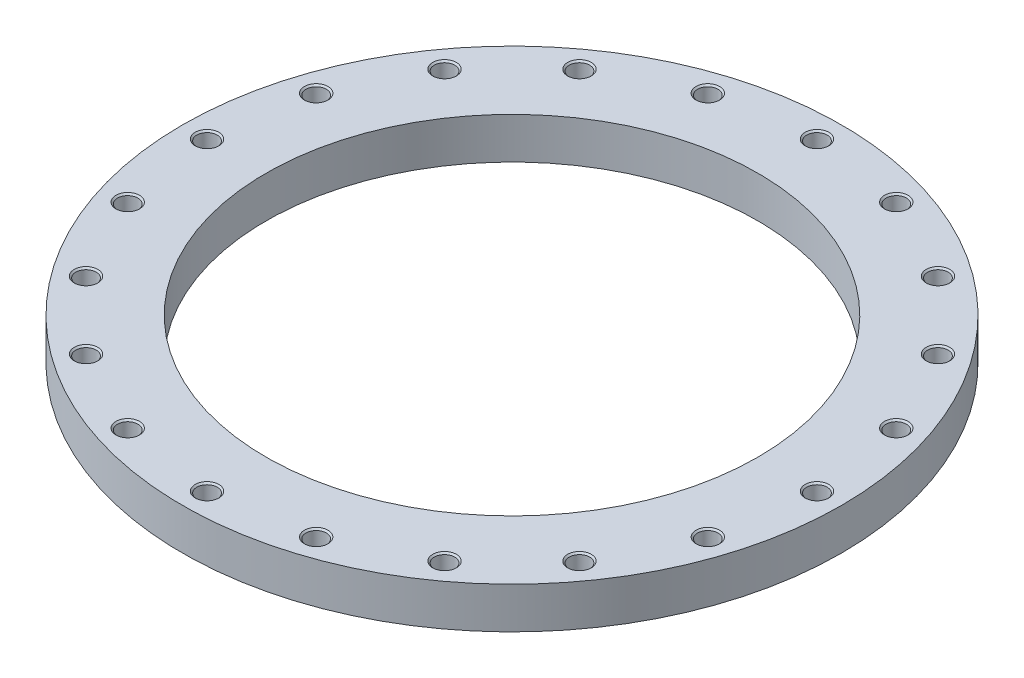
ISO-10303-21;
HEADER;
FILE_DESCRIPTION(('STEP AP214'),'2;1');
FILE_NAME('part.step','',(''),(''),'','','');
FILE_SCHEMA(('AUTOMOTIVE_DESIGN { 1 0 10303 214 1 1 1 1 }'));
ENDSEC;
DATA;
#1=APPLICATION_CONTEXT('core data for automotive mechanical design processes');
#2=APPLICATION_PROTOCOL_DEFINITION('international standard','automotive_design',2000,#1);
#3=PRODUCT_CONTEXT('',#1,'mechanical');
#4=PRODUCT('Part','Part','',(#3));
#5=PRODUCT_RELATED_PRODUCT_CATEGORY('part','',(#4));
#6=PRODUCT_DEFINITION_FORMATION('','',#4);
#7=PRODUCT_DEFINITION_CONTEXT('part definition',#1,'design');
#8=PRODUCT_DEFINITION('design','',#6,#7);
#9=PRODUCT_DEFINITION_SHAPE('','',#8);
#10=(LENGTH_UNIT() NAMED_UNIT(*) SI_UNIT(.MILLI.,.METRE.));
#11=(NAMED_UNIT(*) PLANE_ANGLE_UNIT() SI_UNIT($,.RADIAN.));
#12=(NAMED_UNIT(*) SI_UNIT($,.STERADIAN.) SOLID_ANGLE_UNIT());
#13=UNCERTAINTY_MEASURE_WITH_UNIT(LENGTH_MEASURE(1.E-05),#10,'distance_accuracy_value','');
#14=(GEOMETRIC_REPRESENTATION_CONTEXT(3) GLOBAL_UNCERTAINTY_ASSIGNED_CONTEXT((#13)) GLOBAL_UNIT_ASSIGNED_CONTEXT((#10,
#11,#12)) REPRESENTATION_CONTEXT('',''));
#15=CARTESIAN_POINT('',(0.,0.,0.));
#16=DIRECTION('',(0.,0.,1.));
#17=DIRECTION('',(1.,0.,0.));
#18=AXIS2_PLACEMENT_3D('',#15,#16,#17);
#19=CARTESIAN_POINT('',(0.,21.,0.));
#20=DIRECTION('',(0.,-1.,0.));
#21=DIRECTION('',(1.,0.,0.));
#22=AXIS2_PLACEMENT_3D('',#19,#20,#21);
#23=CYLINDRICAL_SURFACE('',#22,335.);
#24=CARTESIAN_POINT('',(0.,0.,0.));
#25=DIRECTION('',(0.,1.,0.));
#26=DIRECTION('',(1.,0.,0.));
#27=AXIS2_PLACEMENT_3D('',#24,#25,#26);
#28=CIRCLE('',#27,335.);
#29=CARTESIAN_POINT('',(335.,0.,0.));
#30=VERTEX_POINT('',#29);
#31=EDGE_CURVE('E9',#30,#30,#28,.T.);
#32=ORIENTED_EDGE('',*,*,#31,.T.);
#33=EDGE_LOOP('',(#32));
#34=FACE_BOUND('',#33,.T.);
#35=CARTESIAN_POINT('',(0.,42.,0.));
#36=DIRECTION('',(0.,1.,0.));
#37=DIRECTION('',(1.,0.,0.));
#38=AXIS2_PLACEMENT_3D('',#35,#36,#37);
#39=CIRCLE('',#38,335.);
#40=CARTESIAN_POINT('',(335.,42.,0.));
#41=VERTEX_POINT('',#40);
#42=EDGE_CURVE('E617',#41,#41,#39,.T.);
#43=ORIENTED_EDGE('',*,*,#42,.F.);
#44=EDGE_LOOP('',(#43));
#45=FACE_BOUND('',#44,.T.);
#46=ADVANCED_FACE('F15',(#34,#45),#23,.T.);
#47=CARTESIAN_POINT('',(292.5,0.,0.));
#48=DIRECTION('',(0.,-1.,0.));
#49=DIRECTION('',(-1.,0.,0.));
#50=AXIS2_PLACEMENT_3D('',#47,#48,#49);
#51=PLANE('',#50);
#52=CARTESIAN_POINT('',(0.,0.,0.));
#53=DIRECTION('',(0.,1.,0.));
#54=DIRECTION('',(1.,0.,0.));
#55=AXIS2_PLACEMENT_3D('',#52,#53,#54);
#56=CIRCLE('',#55,250.);
#57=CARTESIAN_POINT('',(250.,0.,0.));
#58=VERTEX_POINT('',#57);
#59=EDGE_CURVE('E24',#58,#58,#56,.T.);
#60=ORIENTED_EDGE('',*,*,#59,.T.);
#61=EDGE_LOOP('',(#60));
#62=FACE_BOUND('',#61,.T.);
#63=ORIENTED_EDGE('',*,*,#31,.F.);
#64=EDGE_LOOP('',(#63));
#65=FACE_BOUND('',#64,.T.);
#66=ADVANCED_FACE('F728',(#62,#65),#51,.T.);
#67=CARTESIAN_POINT('',(0.,21.,0.));
#68=DIRECTION('',(0.,-1.,0.));
#69=DIRECTION('',(1.,0.,0.));
#70=AXIS2_PLACEMENT_3D('',#67,#68,#69);
#71=CYLINDRICAL_SURFACE('',#70,250.);
#72=CARTESIAN_POINT('',(0.,42.,0.));
#73=DIRECTION('',(0.,1.,0.));
#74=DIRECTION('',(1.,0.,0.));
#75=AXIS2_PLACEMENT_3D('',#72,#73,#74);
#76=CIRCLE('',#75,250.);
#77=CARTESIAN_POINT('',(250.,42.,0.));
#78=VERTEX_POINT('',#77);
#79=EDGE_CURVE('E482',#78,#78,#76,.T.);
#80=ORIENTED_EDGE('',*,*,#79,.T.);
#81=EDGE_LOOP('',(#80));
#82=FACE_BOUND('',#81,.T.);
#83=ORIENTED_EDGE('',*,*,#59,.F.);
#84=EDGE_LOOP('',(#83));
#85=FACE_BOUND('',#84,.T.);
#86=ADVANCED_FACE('F722',(#82,#85),#71,.F.);
#87=CARTESIAN_POINT('',(292.5,42.,0.));
#88=DIRECTION('',(0.,1.,0.));
#89=DIRECTION('',(1.,0.,0.));
#90=AXIS2_PLACEMENT_3D('',#87,#88,#89);
#91=PLANE('',#90);
#92=ORIENTED_EDGE('',*,*,#42,.T.);
#93=EDGE_LOOP('',(#92));
#94=FACE_BOUND('',#93,.T.);
#95=ORIENTED_EDGE('',*,*,#79,.F.);
#96=EDGE_LOOP('',(#95));
#97=FACE_BOUND('',#96,.T.);
#98=CARTESIAN_POINT('',(310.,42.,0.));
#99=DIRECTION('',(0.,-1.,0.));
#100=DIRECTION('',(1.,0.,0.));
#101=AXIS2_PLACEMENT_3D('',#98,#99,#100);
#102=CIRCLE('',#101,12.);
#103=CARTESIAN_POINT('',(322.,42.,0.));
#104=VERTEX_POINT('',#103);
#105=EDGE_CURVE('E492',#104,#104,#102,.T.);
#106=ORIENTED_EDGE('',*,*,#105,.T.);
#107=EDGE_LOOP('',(#106));
#108=FACE_BOUND('',#107,.T.);
#109=CARTESIAN_POINT('',(294.827520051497,42.,-95.7952682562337));
#110=DIRECTION('',(0.,-1.,0.));
#111=DIRECTION('',(0.951056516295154,0.,-0.309016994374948));
#112=AXIS2_PLACEMENT_3D('',#109,#110,#111);
#113=CIRCLE('',#112,12.);
#114=CARTESIAN_POINT('',(306.24019824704,42.,-99.503472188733));
#115=VERTEX_POINT('',#114);
#116=EDGE_CURVE('E535',#115,#115,#113,.T.);
#117=ORIENTED_EDGE('',*,*,#116,.T.);
#118=EDGE_LOOP('',(#117));
#119=FACE_BOUND('',#118,.T.);
#120=CARTESIAN_POINT('',(250.795268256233,42.,-182.213428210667));
#121=DIRECTION('',(0.,-1.,0.));
#122=DIRECTION('',(0.809016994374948,0.,-0.587785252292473));
#123=AXIS2_PLACEMENT_3D('',#120,#121,#122);
#124=CIRCLE('',#123,12.);
#125=CARTESIAN_POINT('',(260.503472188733,42.,-189.266851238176));
#126=VERTEX_POINT('',#125);
#127=EDGE_CURVE('E483',#126,#126,#124,.T.);
#128=ORIENTED_EDGE('',*,*,#127,.T.);
#129=EDGE_LOOP('',(#128));
#130=FACE_BOUND('',#129,.T.);
#131=CARTESIAN_POINT('',(182.213428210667,42.,-250.795268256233));
#132=DIRECTION('',(0.,-1.,0.));
#133=DIRECTION('',(0.587785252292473,0.,-0.809016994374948));
#134=AXIS2_PLACEMENT_3D('',#131,#132,#133);
#135=CIRCLE('',#134,12.);
#136=CARTESIAN_POINT('',(189.266851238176,42.,-260.503472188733));
#137=VERTEX_POINT('',#136);
#138=EDGE_CURVE('E511',#137,#137,#135,.T.);
#139=ORIENTED_EDGE('',*,*,#138,.T.);
#140=EDGE_LOOP('',(#139));
#141=FACE_BOUND('',#140,.T.);
#142=CARTESIAN_POINT('',(95.7952682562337,42.,-294.827520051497));
#143=DIRECTION('',(0.,-1.,0.));
#144=DIRECTION('',(0.309016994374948,0.,-0.951056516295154));
#145=AXIS2_PLACEMENT_3D('',#142,#143,#144);
#146=CIRCLE('',#145,12.);
#147=CARTESIAN_POINT('',(99.5034721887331,42.,-306.24019824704));
#148=VERTEX_POINT('',#147);
#149=EDGE_CURVE('E677',#148,#148,#146,.T.);
#150=ORIENTED_EDGE('',*,*,#149,.T.);
#151=EDGE_LOOP('',(#150));
#152=FACE_BOUND('',#151,.T.);
#153=CARTESIAN_POINT('',(0.,42.,-310.));
#154=DIRECTION('',(0.,-1.,0.));
#155=DIRECTION('',(0.,0.,-1.));
#156=AXIS2_PLACEMENT_3D('',#153,#154,#155);
#157=CIRCLE('',#156,12.);
#158=CARTESIAN_POINT('',(0.,42.,-322.));
#159=VERTEX_POINT('',#158);
#160=EDGE_CURVE('E521',#159,#159,#157,.T.);
#161=ORIENTED_EDGE('',*,*,#160,.T.);
#162=EDGE_LOOP('',(#161));
#163=FACE_BOUND('',#162,.T.);
#164=CARTESIAN_POINT('',(-95.7952682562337,42.,-294.827520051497));
#165=DIRECTION('',(0.,-1.,0.));
#166=DIRECTION('',(-0.309016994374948,0.,-0.951056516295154));
#167=AXIS2_PLACEMENT_3D('',#164,#165,#166);
#168=CIRCLE('',#167,12.);
#169=CARTESIAN_POINT('',(-99.503472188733,42.,-306.24019824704));
#170=VERTEX_POINT('',#169);
#171=EDGE_CURVE('E553',#170,#170,#168,.T.);
#172=ORIENTED_EDGE('',*,*,#171,.T.);
#173=EDGE_LOOP('',(#172));
#174=FACE_BOUND('',#173,.T.);
#175=CARTESIAN_POINT('',(-182.213428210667,42.,-250.795268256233));
#176=DIRECTION('',(0.,-1.,0.));
#177=DIRECTION('',(-0.587785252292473,0.,-0.809016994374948));
#178=AXIS2_PLACEMENT_3D('',#175,#176,#177);
#179=CIRCLE('',#178,12.);
#180=CARTESIAN_POINT('',(-189.266851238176,42.,-260.503472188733));
#181=VERTEX_POINT('',#180);
#182=EDGE_CURVE('E578',#181,#181,#179,.T.);
#183=ORIENTED_EDGE('',*,*,#182,.T.);
#184=EDGE_LOOP('',(#183));
#185=FACE_BOUND('',#184,.T.);
#186=CARTESIAN_POINT('',(-250.795268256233,42.,-182.213428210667));
#187=DIRECTION('',(0.,-1.,0.));
#188=DIRECTION('',(-0.809016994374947,0.,-0.587785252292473));
#189=AXIS2_PLACEMENT_3D('',#186,#187,#188);
#190=CIRCLE('',#189,12.);
#191=CARTESIAN_POINT('',(-260.503472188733,42.,-189.266851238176));
#192=VERTEX_POINT('',#191);
#193=EDGE_CURVE('E581',#192,#192,#190,.T.);
#194=ORIENTED_EDGE('',*,*,#193,.T.);
#195=EDGE_LOOP('',(#194));
#196=FACE_BOUND('',#195,.T.);
#197=CARTESIAN_POINT('',(-294.827520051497,42.,-95.7952682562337));
#198=DIRECTION('',(0.,-1.,0.));
#199=DIRECTION('',(-0.951056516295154,0.,-0.309016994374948));
#200=AXIS2_PLACEMENT_3D('',#197,#198,#199);
#201=CIRCLE('',#200,12.);
#202=CARTESIAN_POINT('',(-306.24019824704,42.,-99.5034721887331));
#203=VERTEX_POINT('',#202);
#204=EDGE_CURVE('E641',#203,#203,#201,.T.);
#205=ORIENTED_EDGE('',*,*,#204,.T.);
#206=EDGE_LOOP('',(#205));
#207=FACE_BOUND('',#206,.T.);
#208=CARTESIAN_POINT('',(-310.,42.,0.));
#209=DIRECTION('',(0.,-1.,0.));
#210=DIRECTION('',(-1.,0.,0.));
#211=AXIS2_PLACEMENT_3D('',#208,#209,#210);
#212=CIRCLE('',#211,12.);
#213=CARTESIAN_POINT('',(-322.,42.,0.));
#214=VERTEX_POINT('',#213);
#215=EDGE_CURVE('E628',#214,#214,#212,.T.);
#216=ORIENTED_EDGE('',*,*,#215,.T.);
#217=EDGE_LOOP('',(#216));
#218=FACE_BOUND('',#217,.T.);
#219=CARTESIAN_POINT('',(-294.827520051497,42.,95.7952682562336));
#220=DIRECTION('',(0.,-1.,0.));
#221=DIRECTION('',(-0.951056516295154,0.,0.309016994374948));
#222=AXIS2_PLACEMENT_3D('',#219,#220,#221);
#223=CIRCLE('',#222,12.);
#224=CARTESIAN_POINT('',(-306.24019824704,42.,99.503472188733));
#225=VERTEX_POINT('',#224);
#226=EDGE_CURVE('E589',#225,#225,#223,.T.);
#227=ORIENTED_EDGE('',*,*,#226,.T.);
#228=EDGE_LOOP('',(#227));
#229=FACE_BOUND('',#228,.T.);
#230=CARTESIAN_POINT('',(-250.795268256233,42.,182.213428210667));
#231=DIRECTION('',(0.,-1.,0.));
#232=DIRECTION('',(-0.809016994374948,0.,0.587785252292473));
#233=AXIS2_PLACEMENT_3D('',#230,#231,#232);
#234=CIRCLE('',#233,12.);
#235=CARTESIAN_POINT('',(-260.503472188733,42.,189.266851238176));
#236=VERTEX_POINT('',#235);
#237=EDGE_CURVE('E545',#236,#236,#234,.T.);
#238=ORIENTED_EDGE('',*,*,#237,.T.);
#239=EDGE_LOOP('',(#238));
#240=FACE_BOUND('',#239,.T.);
#241=CARTESIAN_POINT('',(-182.213428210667,42.,250.795268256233));
#242=DIRECTION('',(0.,-1.,0.));
#243=DIRECTION('',(-0.587785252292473,0.,0.809016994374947));
#244=AXIS2_PLACEMENT_3D('',#241,#242,#243);
#245=CIRCLE('',#244,12.);
#246=CARTESIAN_POINT('',(-189.266851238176,42.,260.503472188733));
#247=VERTEX_POINT('',#246);
#248=EDGE_CURVE('E526',#247,#247,#245,.T.);
#249=ORIENTED_EDGE('',*,*,#248,.T.);
#250=EDGE_LOOP('',(#249));
#251=FACE_BOUND('',#250,.T.);
#252=CARTESIAN_POINT('',(-95.7952682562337,42.,294.827520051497));
#253=DIRECTION('',(0.,-1.,0.));
#254=DIRECTION('',(-0.309016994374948,0.,0.951056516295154));
#255=AXIS2_PLACEMENT_3D('',#252,#253,#254);
#256=CIRCLE('',#255,12.);
#257=CARTESIAN_POINT('',(-99.5034721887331,42.,306.24019824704));
#258=VERTEX_POINT('',#257);
#259=EDGE_CURVE('E586',#258,#258,#256,.T.);
#260=ORIENTED_EDGE('',*,*,#259,.T.);
#261=EDGE_LOOP('',(#260));
#262=FACE_BOUND('',#261,.T.);
#263=CARTESIAN_POINT('',(0.,42.,310.));
#264=DIRECTION('',(0.,-1.,0.));
#265=DIRECTION('',(0.,0.,1.));
#266=AXIS2_PLACEMENT_3D('',#263,#264,#265);
#267=CIRCLE('',#266,12.);
#268=CARTESIAN_POINT('',(0.,42.,322.));
#269=VERTEX_POINT('',#268);
#270=EDGE_CURVE('E548',#269,#269,#267,.T.);
#271=ORIENTED_EDGE('',*,*,#270,.T.);
#272=EDGE_LOOP('',(#271));
#273=FACE_BOUND('',#272,.T.);
#274=CARTESIAN_POINT('',(95.7952682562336,42.,294.827520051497));
#275=DIRECTION('',(0.,-1.,0.));
#276=DIRECTION('',(0.309016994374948,0.,0.951056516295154));
#277=AXIS2_PLACEMENT_3D('',#274,#275,#276);
#278=CIRCLE('',#277,12.);
#279=CARTESIAN_POINT('',(99.503472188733,42.,306.24019824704));
#280=VERTEX_POINT('',#279);
#281=EDGE_CURVE('E508',#280,#280,#278,.T.);
#282=ORIENTED_EDGE('',*,*,#281,.T.);
#283=EDGE_LOOP('',(#282));
#284=FACE_BOUND('',#283,.T.);
#285=CARTESIAN_POINT('',(182.213428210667,42.,250.795268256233));
#286=DIRECTION('',(0.,-1.,0.));
#287=DIRECTION('',(0.587785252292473,0.,0.809016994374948));
#288=AXIS2_PLACEMENT_3D('',#285,#286,#287);
#289=CIRCLE('',#288,12.);
#290=CARTESIAN_POINT('',(189.266851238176,42.,260.503472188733));
#291=VERTEX_POINT('',#290);
#292=EDGE_CURVE('E489',#291,#291,#289,.T.);
#293=ORIENTED_EDGE('',*,*,#292,.T.);
#294=EDGE_LOOP('',(#293));
#295=FACE_BOUND('',#294,.T.);
#296=CARTESIAN_POINT('',(250.795268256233,42.,182.213428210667));
#297=DIRECTION('',(0.,-1.,0.));
#298=DIRECTION('',(0.809016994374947,0.,0.587785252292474));
#299=AXIS2_PLACEMENT_3D('',#296,#297,#298);
#300=CIRCLE('',#299,12.);
#301=CARTESIAN_POINT('',(260.503472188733,42.,189.266851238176));
#302=VERTEX_POINT('',#301);
#303=EDGE_CURVE('E460',#302,#302,#300,.T.);
#304=ORIENTED_EDGE('',*,*,#303,.T.);
#305=EDGE_LOOP('',(#304));
#306=FACE_BOUND('',#305,.T.);
#307=CARTESIAN_POINT('',(294.827520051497,42.,95.7952682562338));
#308=DIRECTION('',(0.,-1.,0.));
#309=DIRECTION('',(0.951056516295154,0.,0.309016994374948));
#310=AXIS2_PLACEMENT_3D('',#307,#308,#309);
#311=CIRCLE('',#310,12.);
#312=CARTESIAN_POINT('',(306.24019824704,42.,99.5034721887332));
#313=VERTEX_POINT('',#312);
#314=EDGE_CURVE('E1180',#313,#313,#311,.T.);
#315=ORIENTED_EDGE('',*,*,#314,.T.);
#316=EDGE_LOOP('',(#315));
#317=FACE_BOUND('',#316,.T.);
#318=ADVANCED_FACE('F461',(#94,#97,#108,#119,#130,#141,#152,#163,#174,#185,#196,#207,#218,#229,
#240,#251,#262,#273,#284,#295,#306,#317),#91,.T.);
#319=CARTESIAN_POINT('',(310.,6.00463463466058,0.));
#320=DIRECTION('',(0.,1.,0.));
#321=DIRECTION('',(1.,0.,0.));
#322=AXIS2_PLACEMENT_3D('',#319,#320,#321);
#323=CONICAL_SURFACE('',#322,5.188125,1.0471975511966);
#324=CARTESIAN_POINT('',(310.,9.,0.));
#325=DIRECTION('',(0.,-1.,0.));
#326=DIRECTION('',(1.,0.,0.));
#327=AXIS2_PLACEMENT_3D('',#324,#325,#326);
#328=CIRCLE('',#327,10.37625);
#329=CARTESIAN_POINT('',(320.37625,9.,0.));
#330=VERTEX_POINT('',#329);
#331=EDGE_CURVE('E480',#330,#330,#328,.T.);
#332=ORIENTED_EDGE('',*,*,#331,.F.);
#333=EDGE_LOOP('',(#332));
#334=FACE_BOUND('',#333,.T.);
#335=CARTESIAN_POINT('',(310.,3.00926926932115,0.));
#336=VERTEX_POINT('',#335);
#337=VERTEX_LOOP('',#336);
#338=FACE_BOUND('',#337,.T.);
#339=ADVANCED_FACE('F711',(#334,#338),#323,.F.);
#340=CARTESIAN_POINT('',(310.,12.688125,0.));
#341=DIRECTION('',(0.,1.,0.));
#342=DIRECTION('',(1.,0.,0.));
#343=AXIS2_PLACEMENT_3D('',#340,#341,#342);
#344=CYLINDRICAL_SURFACE('',#343,10.37625);
#345=CARTESIAN_POINT('',(310.,16.37625,0.));
#346=DIRECTION('',(0.,-1.,0.));
#347=DIRECTION('',(1.,0.,0.));
#348=AXIS2_PLACEMENT_3D('',#345,#346,#347);
#349=CIRCLE('',#348,10.37625);
#350=CARTESIAN_POINT('',(320.37625,16.37625,0.));
#351=VERTEX_POINT('',#350);
#352=EDGE_CURVE('E19',#351,#351,#349,.T.);
#353=ORIENTED_EDGE('',*,*,#352,.F.);
#354=EDGE_LOOP('',(#353));
#355=FACE_BOUND('',#354,.T.);
#356=ORIENTED_EDGE('',*,*,#331,.T.);
#357=EDGE_LOOP('',(#356));
#358=FACE_BOUND('',#357,.T.);
#359=ADVANCED_FACE('F705',(#355,#358),#344,.F.);
#360=CARTESIAN_POINT('',(310.,17.188125,0.));
#361=DIRECTION('',(0.,1.,0.));
#362=DIRECTION('',(1.,0.,0.));
#363=AXIS2_PLACEMENT_3D('',#360,#361,#362);
#364=CONICAL_SURFACE('',#363,11.188125,0.785398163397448);
#365=CARTESIAN_POINT('',(310.,18.,0.));
#366=DIRECTION('',(0.,-1.,0.));
#367=DIRECTION('',(1.,0.,0.));
#368=AXIS2_PLACEMENT_3D('',#365,#366,#367);
#369=CIRCLE('',#368,12.);
#370=CARTESIAN_POINT('',(322.,18.,0.));
#371=VERTEX_POINT('',#370);
#372=EDGE_CURVE('E587',#371,#371,#369,.T.);
#373=ORIENTED_EDGE('',*,*,#372,.F.);
#374=EDGE_LOOP('',(#373));
#375=FACE_BOUND('',#374,.T.);
#376=ORIENTED_EDGE('',*,*,#352,.T.);
#377=EDGE_LOOP('',(#376));
#378=FACE_BOUND('',#377,.T.);
#379=ADVANCED_FACE('F699',(#375,#378),#364,.F.);
#380=CARTESIAN_POINT('',(321.188125,18.,0.));
#381=DIRECTION('',(0.,1.,0.));
#382=DIRECTION('',(-1.,0.,0.));
#383=AXIS2_PLACEMENT_3D('',#380,#381,#382);
#384=PLANE('',#383);
#385=CARTESIAN_POINT('',(310.,18.,0.));
#386=DIRECTION('',(0.,-1.,0.));
#387=DIRECTION('',(1.,0.,0.));
#388=AXIS2_PLACEMENT_3D('',#385,#386,#387);
#389=CIRCLE('',#388,10.37625);
#390=CARTESIAN_POINT('',(320.37625,18.,0.));
#391=VERTEX_POINT('',#390);
#392=EDGE_CURVE('E550',#391,#391,#389,.T.);
#393=ORIENTED_EDGE('',*,*,#392,.F.);
#394=EDGE_LOOP('',(#393));
#395=FACE_BOUND('',#394,.T.);
#396=ORIENTED_EDGE('',*,*,#372,.T.);
#397=EDGE_LOOP('',(#396));
#398=FACE_BOUND('',#397,.T.);
#399=ADVANCED_FACE('F696',(#395,#398),#384,.F.);
#400=CARTESIAN_POINT('',(310.,29.188125,0.));
#401=DIRECTION('',(0.,1.,0.));
#402=DIRECTION('',(1.,0.,0.));
#403=AXIS2_PLACEMENT_3D('',#400,#401,#402);
#404=CYLINDRICAL_SURFACE('',#403,10.37625);
#405=CARTESIAN_POINT('',(310.,40.37625,0.));
#406=DIRECTION('',(0.,-1.,0.));
#407=DIRECTION('',(1.,0.,0.));
#408=AXIS2_PLACEMENT_3D('',#405,#406,#407);
#409=CIRCLE('',#408,10.37625);
#410=CARTESIAN_POINT('',(320.37625,40.37625,0.));
#411=VERTEX_POINT('',#410);
#412=EDGE_CURVE('E491',#411,#411,#409,.T.);
#413=ORIENTED_EDGE('',*,*,#412,.F.);
#414=EDGE_LOOP('',(#413));
#415=FACE_BOUND('',#414,.T.);
#416=ORIENTED_EDGE('',*,*,#392,.T.);
#417=EDGE_LOOP('',(#416));
#418=FACE_BOUND('',#417,.T.);
#419=ADVANCED_FACE('F694',(#415,#418),#404,.F.);
#420=CARTESIAN_POINT('',(310.,41.188125,0.));
#421=DIRECTION('',(0.,1.,0.));
#422=DIRECTION('',(1.,0.,0.));
#423=AXIS2_PLACEMENT_3D('',#420,#421,#422);
#424=CONICAL_SURFACE('',#423,11.188125,0.785398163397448);
#425=ORIENTED_EDGE('',*,*,#105,.F.);
#426=EDGE_LOOP('',(#425));
#427=FACE_BOUND('',#426,.T.);
#428=ORIENTED_EDGE('',*,*,#412,.T.);
#429=EDGE_LOOP('',(#428));
#430=FACE_BOUND('',#429,.T.);
#431=ADVANCED_FACE('F17',(#427,#430),#424,.F.);
#432=CARTESIAN_POINT('',(294.827520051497,6.00463463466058,-95.7952682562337));
#433=DIRECTION('',(0.,1.,0.));
#434=DIRECTION('',(0.951056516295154,0.,-0.309016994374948));
#435=AXIS2_PLACEMENT_3D('',#432,#433,#434);
#436=CONICAL_SURFACE('',#435,5.188125,1.0471975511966);
#437=CARTESIAN_POINT('',(294.827520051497,9.,-95.7952682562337));
#438=DIRECTION('',(0.,-1.,0.));
#439=DIRECTION('',(0.951056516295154,0.,-0.309016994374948));
#440=AXIS2_PLACEMENT_3D('',#437,#438,#439);
#441=CIRCLE('',#440,10.37625);
#442=CARTESIAN_POINT('',(304.695920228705,9.,-99.0017058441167));
#443=VERTEX_POINT('',#442);
#444=EDGE_CURVE('E493',#443,#443,#441,.T.);
#445=ORIENTED_EDGE('',*,*,#444,.F.);
#446=EDGE_LOOP('',(#445));
#447=FACE_BOUND('',#446,.T.);
#448=CARTESIAN_POINT('',(294.827520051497,3.00926926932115,-95.7952682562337));
#449=VERTEX_POINT('',#448);
#450=VERTEX_LOOP('',#449);
#451=FACE_BOUND('',#450,.T.);
#452=ADVANCED_FACE('F786',(#447,#451),#436,.F.);
#453=CARTESIAN_POINT('',(294.827520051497,12.688125,-95.7952682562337));
#454=DIRECTION('',(0.,1.,0.));
#455=DIRECTION('',(0.951056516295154,0.,-0.309016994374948));
#456=AXIS2_PLACEMENT_3D('',#453,#454,#455);
#457=CYLINDRICAL_SURFACE('',#456,10.37625);
#458=CARTESIAN_POINT('',(294.827520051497,16.37625,-95.7952682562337));
#459=DIRECTION('',(0.,-1.,0.));
#460=DIRECTION('',(0.951056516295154,0.,-0.309016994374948));
#461=AXIS2_PLACEMENT_3D('',#458,#459,#460);
#462=CIRCLE('',#461,10.37625);
#463=CARTESIAN_POINT('',(304.695920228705,16.37625,-99.0017058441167));
#464=VERTEX_POINT('',#463);
#465=EDGE_CURVE('E576',#464,#464,#462,.T.);
#466=ORIENTED_EDGE('',*,*,#465,.F.);
#467=EDGE_LOOP('',(#466));
#468=FACE_BOUND('',#467,.T.);
#469=ORIENTED_EDGE('',*,*,#444,.T.);
#470=EDGE_LOOP('',(#469));
#471=FACE_BOUND('',#470,.T.);
#472=ADVANCED_FACE('F780',(#468,#471),#457,.F.);
#473=CARTESIAN_POINT('',(294.827520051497,17.188125,-95.7952682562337));
#474=DIRECTION('',(0.,1.,0.));
#475=DIRECTION('',(0.951056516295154,0.,-0.309016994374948));
#476=AXIS2_PLACEMENT_3D('',#473,#474,#475);
#477=CONICAL_SURFACE('',#476,11.188125,0.785398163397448);
#478=CARTESIAN_POINT('',(294.827520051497,18.,-95.7952682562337));
#479=DIRECTION('',(0.,-1.,0.));
#480=DIRECTION('',(0.951056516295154,0.,-0.309016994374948));
#481=AXIS2_PLACEMENT_3D('',#478,#479,#480);
#482=CIRCLE('',#481,12.);
#483=CARTESIAN_POINT('',(306.24019824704,18.,-99.503472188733));
#484=VERTEX_POINT('',#483);
#485=EDGE_CURVE('E574',#484,#484,#482,.T.);
#486=ORIENTED_EDGE('',*,*,#485,.F.);
#487=EDGE_LOOP('',(#486));
#488=FACE_BOUND('',#487,.T.);
#489=ORIENTED_EDGE('',*,*,#465,.T.);
#490=EDGE_LOOP('',(#489));
#491=FACE_BOUND('',#490,.T.);
#492=ADVANCED_FACE('F769',(#488,#491),#477,.F.);
#493=CARTESIAN_POINT('',(305.468059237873,18.,-99.2525890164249));
#494=DIRECTION('',(0.,1.,0.));
#495=DIRECTION('',(-0.951056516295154,0.,0.309016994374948));
#496=AXIS2_PLACEMENT_3D('',#493,#494,#495);
#497=PLANE('',#496);
#498=CARTESIAN_POINT('',(294.827520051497,18.,-95.7952682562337));
#499=DIRECTION('',(0.,-1.,0.));
#500=DIRECTION('',(0.951056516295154,0.,-0.309016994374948));
#501=AXIS2_PLACEMENT_3D('',#498,#499,#500);
#502=CIRCLE('',#501,10.37625);
#503=CARTESIAN_POINT('',(304.695920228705,18.,-99.0017058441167));
#504=VERTEX_POINT('',#503);
#505=EDGE_CURVE('E577',#504,#504,#502,.T.);
#506=ORIENTED_EDGE('',*,*,#505,.F.);
#507=EDGE_LOOP('',(#506));
#508=FACE_BOUND('',#507,.T.);
#509=ORIENTED_EDGE('',*,*,#485,.T.);
#510=EDGE_LOOP('',(#509));
#511=FACE_BOUND('',#510,.T.);
#512=ADVANCED_FACE('F764',(#508,#511),#497,.F.);
#513=CARTESIAN_POINT('',(294.827520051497,29.188125,-95.7952682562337));
#514=DIRECTION('',(0.,1.,0.));
#515=DIRECTION('',(0.951056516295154,0.,-0.309016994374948));
#516=AXIS2_PLACEMENT_3D('',#513,#514,#515);
#517=CYLINDRICAL_SURFACE('',#516,10.37625);
#518=CARTESIAN_POINT('',(294.827520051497,40.37625,-95.7952682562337));
#519=DIRECTION('',(0.,-1.,0.));
#520=DIRECTION('',(0.951056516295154,0.,-0.309016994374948));
#521=AXIS2_PLACEMENT_3D('',#518,#519,#520);
#522=CIRCLE('',#521,10.37625);
#523=CARTESIAN_POINT('',(304.695920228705,40.37625,-99.0017058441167));
#524=VERTEX_POINT('',#523);
#525=EDGE_CURVE('E533',#524,#524,#522,.T.);
#526=ORIENTED_EDGE('',*,*,#525,.F.);
#527=EDGE_LOOP('',(#526));
#528=FACE_BOUND('',#527,.T.);
#529=ORIENTED_EDGE('',*,*,#505,.T.);
#530=EDGE_LOOP('',(#529));
#531=FACE_BOUND('',#530,.T.);
#532=ADVANCED_FACE('F761',(#528,#531),#517,.F.);
#533=CARTESIAN_POINT('',(294.827520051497,41.188125,-95.7952682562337));
#534=DIRECTION('',(0.,1.,0.));
#535=DIRECTION('',(0.951056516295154,0.,-0.309016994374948));
#536=AXIS2_PLACEMENT_3D('',#533,#534,#535);
#537=CONICAL_SURFACE('',#536,11.188125,0.785398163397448);
#538=ORIENTED_EDGE('',*,*,#116,.F.);
#539=EDGE_LOOP('',(#538));
#540=FACE_BOUND('',#539,.T.);
#541=ORIENTED_EDGE('',*,*,#525,.T.);
#542=EDGE_LOOP('',(#541));
#543=FACE_BOUND('',#542,.T.);
#544=ADVANCED_FACE('F758',(#540,#543),#537,.F.);
#545=CARTESIAN_POINT('',(250.795268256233,6.00463463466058,-182.213428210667));
#546=DIRECTION('',(0.,1.,0.));
#547=DIRECTION('',(0.809016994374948,0.,-0.587785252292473));
#548=AXIS2_PLACEMENT_3D('',#545,#546,#547);
#549=CONICAL_SURFACE('',#548,5.188125,1.0471975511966);
#550=CARTESIAN_POINT('',(250.795268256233,9.,-182.213428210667));
#551=DIRECTION('',(0.,-1.,0.));
#552=DIRECTION('',(0.809016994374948,0.,-0.587785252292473));
#553=AXIS2_PLACEMENT_3D('',#550,#551,#552);
#554=CIRCLE('',#553,10.37625);
#555=CARTESIAN_POINT('',(259.189830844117,9.,-188.312434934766));
#556=VERTEX_POINT('',#555);
#557=EDGE_CURVE('E536',#556,#556,#554,.T.);
#558=ORIENTED_EDGE('',*,*,#557,.F.);
#559=EDGE_LOOP('',(#558));
#560=FACE_BOUND('',#559,.T.);
#561=CARTESIAN_POINT('',(250.795268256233,3.00926926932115,-182.213428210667));
#562=VERTEX_POINT('',#561);
#563=VERTEX_LOOP('',#562);
#564=FACE_BOUND('',#563,.T.);
#565=ADVANCED_FACE('F754',(#560,#564),#549,.F.);
#566=CARTESIAN_POINT('',(250.795268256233,12.688125,-182.213428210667));
#567=DIRECTION('',(0.,1.,0.));
#568=DIRECTION('',(0.809016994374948,0.,-0.587785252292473));
#569=AXIS2_PLACEMENT_3D('',#566,#567,#568);
#570=CYLINDRICAL_SURFACE('',#569,10.37625);
#571=CARTESIAN_POINT('',(250.795268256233,16.37625,-182.213428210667));
#572=DIRECTION('',(0.,-1.,0.));
#573=DIRECTION('',(0.809016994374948,0.,-0.587785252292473));
#574=AXIS2_PLACEMENT_3D('',#571,#572,#573);
#575=CIRCLE('',#574,10.37625);
#576=CARTESIAN_POINT('',(259.189830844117,16.37625,-188.312434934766));
#577=VERTEX_POINT('',#576);
#578=EDGE_CURVE('E652',#577,#577,#575,.T.);
#579=ORIENTED_EDGE('',*,*,#578,.F.);
#580=EDGE_LOOP('',(#579));
#581=FACE_BOUND('',#580,.T.);
#582=ORIENTED_EDGE('',*,*,#557,.T.);
#583=EDGE_LOOP('',(#582));
#584=FACE_BOUND('',#583,.T.);
#585=ADVANCED_FACE('F750',(#581,#584),#570,.F.);
#586=CARTESIAN_POINT('',(250.795268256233,17.188125,-182.213428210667));
#587=DIRECTION('',(0.,1.,0.));
#588=DIRECTION('',(0.809016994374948,0.,-0.587785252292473));
#589=AXIS2_PLACEMENT_3D('',#586,#587,#588);
#590=CONICAL_SURFACE('',#589,11.188125,0.785398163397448);
#591=CARTESIAN_POINT('',(250.795268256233,18.,-182.213428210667));
#592=DIRECTION('',(0.,-1.,0.));
#593=DIRECTION('',(0.809016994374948,0.,-0.587785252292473));
#594=AXIS2_PLACEMENT_3D('',#591,#592,#593);
#595=CIRCLE('',#594,12.);
#596=CARTESIAN_POINT('',(260.503472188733,18.,-189.266851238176));
#597=VERTEX_POINT('',#596);
#598=EDGE_CURVE('E657',#597,#597,#595,.T.);
#599=ORIENTED_EDGE('',*,*,#598,.F.);
#600=EDGE_LOOP('',(#599));
#601=FACE_BOUND('',#600,.T.);
#602=ORIENTED_EDGE('',*,*,#578,.T.);
#603=EDGE_LOOP('',(#602));
#604=FACE_BOUND('',#603,.T.);
#605=ADVANCED_FACE('F753',(#601,#604),#590,.F.);
#606=CARTESIAN_POINT('',(259.846651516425,18.,-188.789643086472));
#607=DIRECTION('',(0.,1.,0.));
#608=DIRECTION('',(-0.809016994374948,0.,0.587785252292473));
#609=AXIS2_PLACEMENT_3D('',#606,#607,#608);
#610=PLANE('',#609);
#611=CARTESIAN_POINT('',(250.795268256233,18.,-182.213428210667));
#612=DIRECTION('',(0.,-1.,0.));
#613=DIRECTION('',(0.809016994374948,0.,-0.587785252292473));
#614=AXIS2_PLACEMENT_3D('',#611,#612,#613);
#615=CIRCLE('',#614,10.37625);
#616=CARTESIAN_POINT('',(259.189830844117,18.,-188.312434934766));
#617=VERTEX_POINT('',#616);
#618=EDGE_CURVE('E485',#617,#617,#615,.T.);
#619=ORIENTED_EDGE('',*,*,#618,.F.);
#620=EDGE_LOOP('',(#619));
#621=FACE_BOUND('',#620,.T.);
#622=ORIENTED_EDGE('',*,*,#598,.T.);
#623=EDGE_LOOP('',(#622));
#624=FACE_BOUND('',#623,.T.);
#625=ADVANCED_FACE('F839',(#621,#624),#610,.F.);
#626=CARTESIAN_POINT('',(250.795268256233,29.188125,-182.213428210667));
#627=DIRECTION('',(0.,1.,0.));
#628=DIRECTION('',(0.809016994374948,0.,-0.587785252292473));
#629=AXIS2_PLACEMENT_3D('',#626,#627,#628);
#630=CYLINDRICAL_SURFACE('',#629,10.37625);
#631=CARTESIAN_POINT('',(250.795268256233,40.37625,-182.213428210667));
#632=DIRECTION('',(0.,-1.,0.));
#633=DIRECTION('',(0.809016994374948,0.,-0.587785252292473));
#634=AXIS2_PLACEMENT_3D('',#631,#632,#633);
#635=CIRCLE('',#634,10.37625);
#636=CARTESIAN_POINT('',(259.189830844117,40.37625,-188.312434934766));
#637=VERTEX_POINT('',#636);
#638=EDGE_CURVE('E486',#637,#637,#635,.T.);
#639=ORIENTED_EDGE('',*,*,#638,.F.);
#640=EDGE_LOOP('',(#639));
#641=FACE_BOUND('',#640,.T.);
#642=ORIENTED_EDGE('',*,*,#618,.T.);
#643=EDGE_LOOP('',(#642));
#644=FACE_BOUND('',#643,.T.);
#645=ADVANCED_FACE('F835',(#641,#644),#630,.F.);
#646=CARTESIAN_POINT('',(250.795268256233,41.188125,-182.213428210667));
#647=DIRECTION('',(0.,1.,0.));
#648=DIRECTION('',(0.809016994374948,0.,-0.587785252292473));
#649=AXIS2_PLACEMENT_3D('',#646,#647,#648);
#650=CONICAL_SURFACE('',#649,11.188125,0.785398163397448);
#651=ORIENTED_EDGE('',*,*,#127,.F.);
#652=EDGE_LOOP('',(#651));
#653=FACE_BOUND('',#652,.T.);
#654=ORIENTED_EDGE('',*,*,#638,.T.);
#655=EDGE_LOOP('',(#654));
#656=FACE_BOUND('',#655,.T.);
#657=ADVANCED_FACE('F838',(#653,#656),#650,.F.);
#658=CARTESIAN_POINT('',(182.213428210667,6.00463463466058,-250.795268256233));
#659=DIRECTION('',(0.,1.,0.));
#660=DIRECTION('',(0.587785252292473,0.,-0.809016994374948));
#661=AXIS2_PLACEMENT_3D('',#658,#659,#660);
#662=CONICAL_SURFACE('',#661,5.188125,1.0471975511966);
#663=CARTESIAN_POINT('',(182.213428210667,9.,-250.795268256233));
#664=DIRECTION('',(0.,-1.,0.));
#665=DIRECTION('',(0.587785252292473,0.,-0.809016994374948));
#666=AXIS2_PLACEMENT_3D('',#663,#664,#665);
#667=CIRCLE('',#666,10.37625);
#668=CARTESIAN_POINT('',(188.312434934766,9.,-259.189830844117));
#669=VERTEX_POINT('',#668);
#670=EDGE_CURVE('E566',#669,#669,#667,.T.);
#671=ORIENTED_EDGE('',*,*,#670,.F.);
#672=EDGE_LOOP('',(#671));
#673=FACE_BOUND('',#672,.T.);
#674=CARTESIAN_POINT('',(182.213428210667,3.00926926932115,-250.795268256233));
#675=VERTEX_POINT('',#674);
#676=VERTEX_LOOP('',#675);
#677=FACE_BOUND('',#676,.T.);
#678=ADVANCED_FACE('F748',(#673,#677),#662,.F.);
#679=CARTESIAN_POINT('',(182.213428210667,12.688125,-250.795268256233));
#680=DIRECTION('',(0.,1.,0.));
#681=DIRECTION('',(0.587785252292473,0.,-0.809016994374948));
#682=AXIS2_PLACEMENT_3D('',#679,#680,#681);
#683=CYLINDRICAL_SURFACE('',#682,10.37625);
#684=CARTESIAN_POINT('',(182.213428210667,16.37625,-250.795268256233));
#685=DIRECTION('',(0.,-1.,0.));
#686=DIRECTION('',(0.587785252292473,0.,-0.809016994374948));
#687=AXIS2_PLACEMENT_3D('',#684,#685,#686);
#688=CIRCLE('',#687,10.37625);
#689=CARTESIAN_POINT('',(188.312434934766,16.37625,-259.189830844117));
#690=VERTEX_POINT('',#689);
#691=EDGE_CURVE('E686',#690,#690,#688,.T.);
#692=ORIENTED_EDGE('',*,*,#691,.F.);
#693=EDGE_LOOP('',(#692));
#694=FACE_BOUND('',#693,.T.);
#695=ORIENTED_EDGE('',*,*,#670,.T.);
#696=EDGE_LOOP('',(#695));
#697=FACE_BOUND('',#696,.T.);
#698=ADVANCED_FACE('F745',(#694,#697),#683,.F.);
#699=CARTESIAN_POINT('',(182.213428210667,17.188125,-250.795268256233));
#700=DIRECTION('',(0.,1.,0.));
#701=DIRECTION('',(0.587785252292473,0.,-0.809016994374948));
#702=AXIS2_PLACEMENT_3D('',#699,#700,#701);
#703=CONICAL_SURFACE('',#702,11.188125,0.785398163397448);
#704=CARTESIAN_POINT('',(182.213428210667,18.,-250.795268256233));
#705=DIRECTION('',(0.,-1.,0.));
#706=DIRECTION('',(0.587785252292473,0.,-0.809016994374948));
#707=AXIS2_PLACEMENT_3D('',#704,#705,#706);
#708=CIRCLE('',#707,12.);
#709=CARTESIAN_POINT('',(189.266851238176,18.,-260.503472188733));
#710=VERTEX_POINT('',#709);
#711=EDGE_CURVE('E683',#710,#710,#708,.T.);
#712=ORIENTED_EDGE('',*,*,#711,.F.);
#713=EDGE_LOOP('',(#712));
#714=FACE_BOUND('',#713,.T.);
#715=ORIENTED_EDGE('',*,*,#691,.T.);
#716=EDGE_LOOP('',(#715));
#717=FACE_BOUND('',#716,.T.);
#718=ADVANCED_FACE('F743',(#714,#717),#703,.F.);
#719=CARTESIAN_POINT('',(188.789643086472,18.,-259.846651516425));
#720=DIRECTION('',(0.,1.,0.));
#721=DIRECTION('',(-0.587785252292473,0.,0.809016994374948));
#722=AXIS2_PLACEMENT_3D('',#719,#720,#721);
#723=PLANE('',#722);
#724=CARTESIAN_POINT('',(182.213428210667,18.,-250.795268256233));
#725=DIRECTION('',(0.,-1.,0.));
#726=DIRECTION('',(0.587785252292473,0.,-0.809016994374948));
#727=AXIS2_PLACEMENT_3D('',#724,#725,#726);
#728=CIRCLE('',#727,10.37625);
#729=CARTESIAN_POINT('',(188.312434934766,18.,-259.189830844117));
#730=VERTEX_POINT('',#729);
#731=EDGE_CURVE('E681',#730,#730,#728,.T.);
#732=ORIENTED_EDGE('',*,*,#731,.F.);
#733=EDGE_LOOP('',(#732));
#734=FACE_BOUND('',#733,.T.);
#735=ORIENTED_EDGE('',*,*,#711,.T.);
#736=EDGE_LOOP('',(#735));
#737=FACE_BOUND('',#736,.T.);
#738=ADVANCED_FACE('F739',(#734,#737),#723,.F.);
#739=CARTESIAN_POINT('',(182.213428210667,29.188125,-250.795268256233));
#740=DIRECTION('',(0.,1.,0.));
#741=DIRECTION('',(0.587785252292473,0.,-0.809016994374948));
#742=AXIS2_PLACEMENT_3D('',#739,#740,#741);
#743=CYLINDRICAL_SURFACE('',#742,10.37625);
#744=CARTESIAN_POINT('',(182.213428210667,40.37625,-250.795268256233));
#745=DIRECTION('',(0.,-1.,0.));
#746=DIRECTION('',(0.587785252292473,0.,-0.809016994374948));
#747=AXIS2_PLACEMENT_3D('',#744,#745,#746);
#748=CIRCLE('',#747,10.37625);
#749=CARTESIAN_POINT('',(188.312434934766,40.37625,-259.189830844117));
#750=VERTEX_POINT('',#749);
#751=EDGE_CURVE('E509',#750,#750,#748,.T.);
#752=ORIENTED_EDGE('',*,*,#751,.F.);
#753=EDGE_LOOP('',(#752));
#754=FACE_BOUND('',#753,.T.);
#755=ORIENTED_EDGE('',*,*,#731,.T.);
#756=EDGE_LOOP('',(#755));
#757=FACE_BOUND('',#756,.T.);
#758=ADVANCED_FACE('F742',(#754,#757),#743,.F.);
#759=CARTESIAN_POINT('',(182.213428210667,41.188125,-250.795268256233));
#760=DIRECTION('',(0.,1.,0.));
#761=DIRECTION('',(0.587785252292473,0.,-0.809016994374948));
#762=AXIS2_PLACEMENT_3D('',#759,#760,#761);
#763=CONICAL_SURFACE('',#762,11.188125,0.785398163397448);
#764=ORIENTED_EDGE('',*,*,#138,.F.);
#765=EDGE_LOOP('',(#764));
#766=FACE_BOUND('',#765,.T.);
#767=ORIENTED_EDGE('',*,*,#751,.T.);
#768=EDGE_LOOP('',(#767));
#769=FACE_BOUND('',#768,.T.);
#770=ADVANCED_FACE('F1016',(#766,#769),#763,.F.);
#771=CARTESIAN_POINT('',(95.7952682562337,6.00463463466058,-294.827520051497));
#772=DIRECTION('',(0.,1.,0.));
#773=DIRECTION('',(0.309016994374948,0.,-0.951056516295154));
#774=AXIS2_PLACEMENT_3D('',#771,#772,#773);
#775=CONICAL_SURFACE('',#774,5.188125,1.0471975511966);
#776=CARTESIAN_POINT('',(95.7952682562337,9.,-294.827520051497));
#777=DIRECTION('',(0.,-1.,0.));
#778=DIRECTION('',(0.309016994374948,0.,-0.951056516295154));
#779=AXIS2_PLACEMENT_3D('',#776,#777,#778);
#780=CIRCLE('',#779,10.37625);
#781=CARTESIAN_POINT('',(99.0017058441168,9.,-304.695920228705));
#782=VERTEX_POINT('',#781);
#783=EDGE_CURVE('E512',#782,#782,#780,.T.);
#784=ORIENTED_EDGE('',*,*,#783,.F.);
#785=EDGE_LOOP('',(#784));
#786=FACE_BOUND('',#785,.T.);
#787=CARTESIAN_POINT('',(95.7952682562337,3.00926926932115,-294.827520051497));
#788=VERTEX_POINT('',#787);
#789=VERTEX_LOOP('',#788);
#790=FACE_BOUND('',#789,.T.);
#791=ADVANCED_FACE('F737',(#786,#790),#775,.F.);
#792=CARTESIAN_POINT('',(95.7952682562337,12.688125,-294.827520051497));
#793=DIRECTION('',(0.,1.,0.));
#794=DIRECTION('',(0.309016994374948,0.,-0.951056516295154));
#795=AXIS2_PLACEMENT_3D('',#792,#793,#794);
#796=CYLINDRICAL_SURFACE('',#795,10.37625);
#797=CARTESIAN_POINT('',(95.7952682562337,16.37625,-294.827520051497));
#798=DIRECTION('',(0.,-1.,0.));
#799=DIRECTION('',(0.309016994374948,0.,-0.951056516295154));
#800=AXIS2_PLACEMENT_3D('',#797,#798,#799);
#801=CIRCLE('',#800,10.37625);
#802=CARTESIAN_POINT('',(99.0017058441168,16.37625,-304.695920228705));
#803=VERTEX_POINT('',#802);
#804=EDGE_CURVE('E611',#803,#803,#801,.T.);
#805=ORIENTED_EDGE('',*,*,#804,.F.);
#806=EDGE_LOOP('',(#805));
#807=FACE_BOUND('',#806,.T.);
#808=ORIENTED_EDGE('',*,*,#783,.T.);
#809=EDGE_LOOP('',(#808));
#810=FACE_BOUND('',#809,.T.);
#811=ADVANCED_FACE('F1009',(#807,#810),#796,.F.);
#812=CARTESIAN_POINT('',(95.7952682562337,17.188125,-294.827520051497));
#813=DIRECTION('',(0.,1.,0.));
#814=DIRECTION('',(0.309016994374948,0.,-0.951056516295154));
#815=AXIS2_PLACEMENT_3D('',#812,#813,#814);
#816=CONICAL_SURFACE('',#815,11.188125,0.785398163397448);
#817=CARTESIAN_POINT('',(95.7952682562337,18.,-294.827520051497));
#818=DIRECTION('',(0.,-1.,0.));
#819=DIRECTION('',(0.309016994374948,0.,-0.951056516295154));
#820=AXIS2_PLACEMENT_3D('',#817,#818,#819);
#821=CIRCLE('',#820,12.);
#822=CARTESIAN_POINT('',(99.5034721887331,18.,-306.24019824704));
#823=VERTEX_POINT('',#822);
#824=EDGE_CURVE('E619',#823,#823,#821,.T.);
#825=ORIENTED_EDGE('',*,*,#824,.F.);
#826=EDGE_LOOP('',(#825));
#827=FACE_BOUND('',#826,.T.);
#828=ORIENTED_EDGE('',*,*,#804,.T.);
#829=EDGE_LOOP('',(#828));
#830=FACE_BOUND('',#829,.T.);
#831=ADVANCED_FACE('F854',(#827,#830),#816,.F.);
#832=CARTESIAN_POINT('',(99.2525890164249,18.,-305.468059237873));
#833=DIRECTION('',(0.,1.,0.));
#834=DIRECTION('',(-0.309016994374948,0.,0.951056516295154));
#835=AXIS2_PLACEMENT_3D('',#832,#833,#834);
#836=PLANE('',#835);
#837=CARTESIAN_POINT('',(95.7952682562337,18.,-294.827520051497));
#838=DIRECTION('',(0.,-1.,0.));
#839=DIRECTION('',(0.309016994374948,0.,-0.951056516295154));
#840=AXIS2_PLACEMENT_3D('',#837,#838,#839);
#841=CIRCLE('',#840,10.37625);
#842=CARTESIAN_POINT('',(99.0017058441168,18.,-304.695920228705));
#843=VERTEX_POINT('',#842);
#844=EDGE_CURVE('E621',#843,#843,#841,.T.);
#845=ORIENTED_EDGE('',*,*,#844,.F.);
#846=EDGE_LOOP('',(#845));
#847=FACE_BOUND('',#846,.T.);
#848=ORIENTED_EDGE('',*,*,#824,.T.);
#849=EDGE_LOOP('',(#848));
#850=FACE_BOUND('',#849,.T.);
#851=ADVANCED_FACE('F850',(#847,#850),#836,.F.);
#852=CARTESIAN_POINT('',(95.7952682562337,29.188125,-294.827520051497));
#853=DIRECTION('',(0.,1.,0.));
#854=DIRECTION('',(0.309016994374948,0.,-0.951056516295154));
#855=AXIS2_PLACEMENT_3D('',#852,#853,#854);
#856=CYLINDRICAL_SURFACE('',#855,10.37625);
#857=CARTESIAN_POINT('',(95.7952682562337,40.37625,-294.827520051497));
#858=DIRECTION('',(0.,-1.,0.));
#859=DIRECTION('',(0.309016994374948,0.,-0.951056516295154));
#860=AXIS2_PLACEMENT_3D('',#857,#858,#859);
#861=CIRCLE('',#860,10.37625);
#862=CARTESIAN_POINT('',(99.0017058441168,40.37625,-304.695920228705));
#863=VERTEX_POINT('',#862);
#864=EDGE_CURVE('E541',#863,#863,#861,.T.);
#865=ORIENTED_EDGE('',*,*,#864,.F.);
#866=EDGE_LOOP('',(#865));
#867=FACE_BOUND('',#866,.T.);
#868=ORIENTED_EDGE('',*,*,#844,.T.);
#869=EDGE_LOOP('',(#868));
#870=FACE_BOUND('',#869,.T.);
#871=ADVANCED_FACE('F853',(#867,#870),#856,.F.);
#872=CARTESIAN_POINT('',(95.7952682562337,41.188125,-294.827520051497));
#873=DIRECTION('',(0.,1.,0.));
#874=DIRECTION('',(0.309016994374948,0.,-0.951056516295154));
#875=AXIS2_PLACEMENT_3D('',#872,#873,#874);
#876=CONICAL_SURFACE('',#875,11.188125,0.785398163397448);
#877=ORIENTED_EDGE('',*,*,#149,.F.);
#878=EDGE_LOOP('',(#877));
#879=FACE_BOUND('',#878,.T.);
#880=ORIENTED_EDGE('',*,*,#864,.T.);
#881=EDGE_LOOP('',(#880));
#882=FACE_BOUND('',#881,.T.);
#883=ADVANCED_FACE('F1006',(#879,#882),#876,.F.);
#884=CARTESIAN_POINT('',(0.,6.00463463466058,-310.));
#885=DIRECTION('',(0.,1.,0.));
#886=DIRECTION('',(0.,0.,-1.));
#887=AXIS2_PLACEMENT_3D('',#884,#885,#886);
#888=CONICAL_SURFACE('',#887,5.188125,1.0471975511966);
#889=CARTESIAN_POINT('',(0.,9.,-310.));
#890=DIRECTION('',(0.,-1.,0.));
#891=DIRECTION('',(0.,0.,-1.));
#892=AXIS2_PLACEMENT_3D('',#889,#890,#891);
#893=CIRCLE('',#892,10.37625);
#894=CARTESIAN_POINT('',(0.,9.,-320.37625));
#895=VERTEX_POINT('',#894);
#896=EDGE_CURVE('E539',#895,#895,#893,.T.);
#897=ORIENTED_EDGE('',*,*,#896,.F.);
#898=EDGE_LOOP('',(#897));
#899=FACE_BOUND('',#898,.T.);
#900=CARTESIAN_POINT('',(0.,3.00926926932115,-310.));
#901=VERTEX_POINT('',#900);
#902=VERTEX_LOOP('',#901);
#903=FACE_BOUND('',#902,.T.);
#904=ADVANCED_FACE('F1003',(#899,#903),#888,.F.);
#905=CARTESIAN_POINT('',(0.,12.688125,-310.));
#906=DIRECTION('',(0.,1.,0.));
#907=DIRECTION('',(0.,0.,-1.));
#908=AXIS2_PLACEMENT_3D('',#905,#906,#907);
#909=CYLINDRICAL_SURFACE('',#908,10.37625);
#910=CARTESIAN_POINT('',(0.,16.37625,-310.));
#911=DIRECTION('',(0.,-1.,0.));
#912=DIRECTION('',(0.,0.,-1.));
#913=AXIS2_PLACEMENT_3D('',#910,#911,#912);
#914=CIRCLE('',#913,10.37625);
#915=CARTESIAN_POINT('',(0.,16.37625,-320.37625));
#916=VERTEX_POINT('',#915);
#917=EDGE_CURVE('E542',#916,#916,#914,.T.);
#918=ORIENTED_EDGE('',*,*,#917,.F.);
#919=EDGE_LOOP('',(#918));
#920=FACE_BOUND('',#919,.T.);
#921=ORIENTED_EDGE('',*,*,#896,.T.);
#922=EDGE_LOOP('',(#921));
#923=FACE_BOUND('',#922,.T.);
#924=ADVANCED_FACE('F1001',(#920,#923),#909,.F.);
#925=CARTESIAN_POINT('',(0.,17.188125,-310.));
#926=DIRECTION('',(0.,1.,0.));
#927=DIRECTION('',(0.,0.,-1.));
#928=AXIS2_PLACEMENT_3D('',#925,#926,#927);
#929=CONICAL_SURFACE('',#928,11.188125,0.785398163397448);
#930=CARTESIAN_POINT('',(0.,18.,-310.));
#931=DIRECTION('',(0.,-1.,0.));
#932=DIRECTION('',(0.,0.,-1.));
#933=AXIS2_PLACEMENT_3D('',#930,#931,#932);
#934=CIRCLE('',#933,12.);
#935=CARTESIAN_POINT('',(0.,18.,-322.));
#936=VERTEX_POINT('',#935);
#937=EDGE_CURVE('E642',#936,#936,#934,.T.);
#938=ORIENTED_EDGE('',*,*,#937,.F.);
#939=EDGE_LOOP('',(#938));
#940=FACE_BOUND('',#939,.T.);
#941=ORIENTED_EDGE('',*,*,#917,.T.);
#942=EDGE_LOOP('',(#941));
#943=FACE_BOUND('',#942,.T.);
#944=ADVANCED_FACE('F997',(#940,#943),#929,.F.);
#945=CARTESIAN_POINT('',(0.,18.,-321.188125));
#946=DIRECTION('',(0.,1.,0.));
#947=DIRECTION('',(0.,0.,1.));
#948=AXIS2_PLACEMENT_3D('',#945,#946,#947);
#949=PLANE('',#948);
#950=CARTESIAN_POINT('',(0.,18.,-310.));
#951=DIRECTION('',(0.,-1.,0.));
#952=DIRECTION('',(0.,0.,-1.));
#953=AXIS2_PLACEMENT_3D('',#950,#951,#952);
#954=CIRCLE('',#953,10.37625);
#955=CARTESIAN_POINT('',(0.,18.,-320.37625));
#956=VERTEX_POINT('',#955);
#957=EDGE_CURVE('E644',#956,#956,#954,.T.);
#958=ORIENTED_EDGE('',*,*,#957,.F.);
#959=EDGE_LOOP('',(#958));
#960=FACE_BOUND('',#959,.T.);
#961=ORIENTED_EDGE('',*,*,#937,.T.);
#962=EDGE_LOOP('',(#961));
#963=FACE_BOUND('',#962,.T.);
#964=ADVANCED_FACE('F990',(#960,#963),#949,.F.);
#965=CARTESIAN_POINT('',(0.,29.188125,-310.));
#966=DIRECTION('',(0.,1.,0.));
#967=DIRECTION('',(0.,0.,-1.));
#968=AXIS2_PLACEMENT_3D('',#965,#966,#967);
#969=CYLINDRICAL_SURFACE('',#968,10.37625);
#970=CARTESIAN_POINT('',(0.,40.37625,-310.));
#971=DIRECTION('',(0.,-1.,0.));
#972=DIRECTION('',(0.,0.,-1.));
#973=AXIS2_PLACEMENT_3D('',#970,#971,#972);
#974=CIRCLE('',#973,10.37625);
#975=CARTESIAN_POINT('',(0.,40.37625,-320.37625));
#976=VERTEX_POINT('',#975);
#977=EDGE_CURVE('E519',#976,#976,#974,.T.);
#978=ORIENTED_EDGE('',*,*,#977,.F.);
#979=EDGE_LOOP('',(#978));
#980=FACE_BOUND('',#979,.T.);
#981=ORIENTED_EDGE('',*,*,#957,.T.);
#982=EDGE_LOOP('',(#981));
#983=FACE_BOUND('',#982,.T.);
#984=ADVANCED_FACE('F987',(#980,#983),#969,.F.);
#985=CARTESIAN_POINT('',(0.,41.188125,-310.));
#986=DIRECTION('',(0.,1.,0.));
#987=DIRECTION('',(0.,0.,-1.));
#988=AXIS2_PLACEMENT_3D('',#985,#986,#987);
#989=CONICAL_SURFACE('',#988,11.188125,0.785398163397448);
#990=ORIENTED_EDGE('',*,*,#160,.F.);
#991=EDGE_LOOP('',(#990));
#992=FACE_BOUND('',#991,.T.);
#993=ORIENTED_EDGE('',*,*,#977,.T.);
#994=EDGE_LOOP('',(#993));
#995=FACE_BOUND('',#994,.T.);
#996=ADVANCED_FACE('F985',(#992,#995),#989,.F.);
#997=CARTESIAN_POINT('',(-95.7952682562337,6.00463463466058,-294.827520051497));
#998=DIRECTION('',(0.,1.,0.));
#999=DIRECTION('',(-0.309016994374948,0.,-0.951056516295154));
#1000=AXIS2_PLACEMENT_3D('',#997,#998,#999);
#1001=CONICAL_SURFACE('',#1000,5.188125,1.0471975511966);
#1002=CARTESIAN_POINT('',(-95.7952682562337,9.,-294.827520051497));
#1003=DIRECTION('',(0.,-1.,0.));
#1004=DIRECTION('',(-0.309016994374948,0.,-0.951056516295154));
#1005=AXIS2_PLACEMENT_3D('',#1002,#1003,#1004);
#1006=CIRCLE('',#1005,10.37625);
#1007=CARTESIAN_POINT('',(-99.0017058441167,9.,-304.695920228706));
#1008=VERTEX_POINT('',#1007);
#1009=EDGE_CURVE('E522',#1008,#1008,#1006,.T.);
#1010=ORIENTED_EDGE('',*,*,#1009,.F.);
#1011=EDGE_LOOP('',(#1010));
#1012=FACE_BOUND('',#1011,.T.);
#1013=CARTESIAN_POINT('',(-95.7952682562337,3.00926926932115,-294.827520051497));
#1014=VERTEX_POINT('',#1013);
#1015=VERTEX_LOOP('',#1014);
#1016=FACE_BOUND('',#1015,.T.);
#1017=ADVANCED_FACE('F981',(#1012,#1016),#1001,.F.);
#1018=CARTESIAN_POINT('',(-95.7952682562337,12.688125,-294.827520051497));
#1019=DIRECTION('',(0.,1.,0.));
#1020=DIRECTION('',(-0.309016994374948,0.,-0.951056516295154));
#1021=AXIS2_PLACEMENT_3D('',#1018,#1019,#1020);
#1022=CYLINDRICAL_SURFACE('',#1021,10.37625);
#1023=CARTESIAN_POINT('',(-95.7952682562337,16.37625,-294.827520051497));
#1024=DIRECTION('',(0.,-1.,0.));
#1025=DIRECTION('',(-0.309016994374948,0.,-0.951056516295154));
#1026=AXIS2_PLACEMENT_3D('',#1023,#1024,#1025);
#1027=CIRCLE('',#1026,10.37625);
#1028=CARTESIAN_POINT('',(-99.0017058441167,16.37625,-304.695920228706));
#1029=VERTEX_POINT('',#1028);
#1030=EDGE_CURVE('E670',#1029,#1029,#1027,.T.);
#1031=ORIENTED_EDGE('',*,*,#1030,.F.);
#1032=EDGE_LOOP('',(#1031));
#1033=FACE_BOUND('',#1032,.T.);
#1034=ORIENTED_EDGE('',*,*,#1009,.T.);
#1035=EDGE_LOOP('',(#1034));
#1036=FACE_BOUND('',#1035,.T.);
#1037=ADVANCED_FACE('F977',(#1033,#1036),#1022,.F.);
#1038=CARTESIAN_POINT('',(-95.7952682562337,17.188125,-294.827520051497));
#1039=DIRECTION('',(0.,1.,0.));
#1040=DIRECTION('',(-0.309016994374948,0.,-0.951056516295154));
#1041=AXIS2_PLACEMENT_3D('',#1038,#1039,#1040);
#1042=CONICAL_SURFACE('',#1041,11.188125,0.785398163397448);
#1043=CARTESIAN_POINT('',(-95.7952682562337,18.,-294.827520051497));
#1044=DIRECTION('',(0.,-1.,0.));
#1045=DIRECTION('',(-0.309016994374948,0.,-0.951056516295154));
#1046=AXIS2_PLACEMENT_3D('',#1043,#1044,#1045);
#1047=CIRCLE('',#1046,12.);
#1048=CARTESIAN_POINT('',(-99.503472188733,18.,-306.24019824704));
#1049=VERTEX_POINT('',#1048);
#1050=EDGE_CURVE('E668',#1049,#1049,#1047,.T.);
#1051=ORIENTED_EDGE('',*,*,#1050,.F.);
#1052=EDGE_LOOP('',(#1051));
#1053=FACE_BOUND('',#1052,.T.);
#1054=ORIENTED_EDGE('',*,*,#1030,.T.);
#1055=EDGE_LOOP('',(#1054));
#1056=FACE_BOUND('',#1055,.T.);
#1057=ADVANCED_FACE('F973',(#1053,#1056),#1042,.F.);
#1058=CARTESIAN_POINT('',(-99.2525890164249,18.,-305.468059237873));
#1059=DIRECTION('',(0.,1.,0.));
#1060=DIRECTION('',(0.309016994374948,0.,0.951056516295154));
#1061=AXIS2_PLACEMENT_3D('',#1058,#1059,#1060);
#1062=PLANE('',#1061);
#1063=CARTESIAN_POINT('',(-95.7952682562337,18.,-294.827520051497));
#1064=DIRECTION('',(0.,-1.,0.));
#1065=DIRECTION('',(-0.309016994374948,0.,-0.951056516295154));
#1066=AXIS2_PLACEMENT_3D('',#1063,#1064,#1065);
#1067=CIRCLE('',#1066,10.37625);
#1068=CARTESIAN_POINT('',(-99.0017058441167,18.,-304.695920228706));
#1069=VERTEX_POINT('',#1068);
#1070=EDGE_CURVE('E666',#1069,#1069,#1067,.T.);
#1071=ORIENTED_EDGE('',*,*,#1070,.F.);
#1072=EDGE_LOOP('',(#1071));
#1073=FACE_BOUND('',#1072,.T.);
#1074=ORIENTED_EDGE('',*,*,#1050,.T.);
#1075=EDGE_LOOP('',(#1074));
#1076=FACE_BOUND('',#1075,.T.);
#1077=ADVANCED_FACE('F969',(#1073,#1076),#1062,.F.);
#1078=CARTESIAN_POINT('',(-95.7952682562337,29.188125,-294.827520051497));
#1079=DIRECTION('',(0.,1.,0.));
#1080=DIRECTION('',(-0.309016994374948,0.,-0.951056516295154));
#1081=AXIS2_PLACEMENT_3D('',#1078,#1079,#1080);
#1082=CYLINDRICAL_SURFACE('',#1081,10.37625);
#1083=CARTESIAN_POINT('',(-95.7952682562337,40.37625,-294.827520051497));
#1084=DIRECTION('',(0.,-1.,0.));
#1085=DIRECTION('',(-0.309016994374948,0.,-0.951056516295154));
#1086=AXIS2_PLACEMENT_3D('',#1083,#1084,#1085);
#1087=CIRCLE('',#1086,10.37625);
#1088=CARTESIAN_POINT('',(-99.0017058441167,40.37625,-304.695920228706));
#1089=VERTEX_POINT('',#1088);
#1090=EDGE_CURVE('E551',#1089,#1089,#1087,.T.);
#1091=ORIENTED_EDGE('',*,*,#1090,.F.);
#1092=EDGE_LOOP('',(#1091));
#1093=FACE_BOUND('',#1092,.T.);
#1094=ORIENTED_EDGE('',*,*,#1070,.T.);
#1095=EDGE_LOOP('',(#1094));
#1096=FACE_BOUND('',#1095,.T.);
#1097=ADVANCED_FACE('F966',(#1093,#1096),#1082,.F.);
#1098=CARTESIAN_POINT('',(-95.7952682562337,41.188125,-294.827520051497));
#1099=DIRECTION('',(0.,1.,0.));
#1100=DIRECTION('',(-0.309016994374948,0.,-0.951056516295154));
#1101=AXIS2_PLACEMENT_3D('',#1098,#1099,#1100);
#1102=CONICAL_SURFACE('',#1101,11.188125,0.785398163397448);
#1103=ORIENTED_EDGE('',*,*,#171,.F.);
#1104=EDGE_LOOP('',(#1103));
#1105=FACE_BOUND('',#1104,.T.);
#1106=ORIENTED_EDGE('',*,*,#1090,.T.);
#1107=EDGE_LOOP('',(#1106));
#1108=FACE_BOUND('',#1107,.T.);
#1109=ADVANCED_FACE('F964',(#1105,#1108),#1102,.F.);
#1110=CARTESIAN_POINT('',(-182.213428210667,6.00463463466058,-250.795268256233));
#1111=DIRECTION('',(0.,1.,0.));
#1112=DIRECTION('',(-0.587785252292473,0.,-0.809016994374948));
#1113=AXIS2_PLACEMENT_3D('',#1110,#1111,#1112);
#1114=CONICAL_SURFACE('',#1113,5.188125,1.0471975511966);
#1115=CARTESIAN_POINT('',(-182.213428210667,9.,-250.795268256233));
#1116=DIRECTION('',(0.,-1.,0.));
#1117=DIRECTION('',(-0.587785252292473,0.,-0.809016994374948));
#1118=AXIS2_PLACEMENT_3D('',#1115,#1116,#1117);
#1119=CIRCLE('',#1118,10.37625);
#1120=CARTESIAN_POINT('',(-188.312434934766,9.,-259.189830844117));
#1121=VERTEX_POINT('',#1120);
#1122=EDGE_CURVE('E554',#1121,#1121,#1119,.T.);
#1123=ORIENTED_EDGE('',*,*,#1122,.F.);
#1124=EDGE_LOOP('',(#1123));
#1125=FACE_BOUND('',#1124,.T.);
#1126=CARTESIAN_POINT('',(-182.213428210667,3.00926926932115,-250.795268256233));
#1127=VERTEX_POINT('',#1126);
#1128=VERTEX_LOOP('',#1127);
#1129=FACE_BOUND('',#1128,.T.);
#1130=ADVANCED_FACE('F959',(#1125,#1129),#1114,.F.);
#1131=CARTESIAN_POINT('',(-182.213428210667,12.688125,-250.795268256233));
#1132=DIRECTION('',(0.,1.,0.));
#1133=DIRECTION('',(-0.587785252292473,0.,-0.809016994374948));
#1134=AXIS2_PLACEMENT_3D('',#1131,#1132,#1133);
#1135=CYLINDRICAL_SURFACE('',#1134,10.37625);
#1136=CARTESIAN_POINT('',(-182.213428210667,16.37625,-250.795268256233));
#1137=DIRECTION('',(0.,-1.,0.));
#1138=DIRECTION('',(-0.587785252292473,0.,-0.809016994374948));
#1139=AXIS2_PLACEMENT_3D('',#1136,#1137,#1138);
#1140=CIRCLE('',#1139,10.37625);
#1141=CARTESIAN_POINT('',(-188.312434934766,16.37625,-259.189830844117));
#1142=VERTEX_POINT('',#1141);
#1143=EDGE_CURVE('E477',#1142,#1142,#1140,.T.);
#1144=ORIENTED_EDGE('',*,*,#1143,.F.);
#1145=EDGE_LOOP('',(#1144));
#1146=FACE_BOUND('',#1145,.T.);
#1147=ORIENTED_EDGE('',*,*,#1122,.T.);
#1148=EDGE_LOOP('',(#1147));
#1149=FACE_BOUND('',#1148,.T.);
#1150=ADVANCED_FACE('F956',(#1146,#1149),#1135,.F.);
#1151=CARTESIAN_POINT('',(-182.213428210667,17.188125,-250.795268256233));
#1152=DIRECTION('',(0.,1.,0.));
#1153=DIRECTION('',(-0.587785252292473,0.,-0.809016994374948));
#1154=AXIS2_PLACEMENT_3D('',#1151,#1152,#1153);
#1155=CONICAL_SURFACE('',#1154,11.188125,0.785398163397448);
#1156=CARTESIAN_POINT('',(-182.213428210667,18.,-250.795268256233));
#1157=DIRECTION('',(0.,-1.,0.));
#1158=DIRECTION('',(-0.587785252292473,0.,-0.809016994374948));
#1159=AXIS2_PLACEMENT_3D('',#1156,#1157,#1158);
#1160=CIRCLE('',#1159,12.);
#1161=CARTESIAN_POINT('',(-189.266851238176,18.,-260.503472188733));
#1162=VERTEX_POINT('',#1161);
#1163=EDGE_CURVE('E475',#1162,#1162,#1160,.T.);
#1164=ORIENTED_EDGE('',*,*,#1163,.F.);
#1165=EDGE_LOOP('',(#1164));
#1166=FACE_BOUND('',#1165,.T.);
#1167=ORIENTED_EDGE('',*,*,#1143,.T.);
#1168=EDGE_LOOP('',(#1167));
#1169=FACE_BOUND('',#1168,.T.);
#1170=ADVANCED_FACE('F952',(#1166,#1169),#1155,.F.);
#1171=CARTESIAN_POINT('',(-188.789643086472,18.,-259.846651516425));
#1172=DIRECTION('',(0.,1.,0.));
#1173=DIRECTION('',(0.587785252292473,0.,0.809016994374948));
#1174=AXIS2_PLACEMENT_3D('',#1171,#1172,#1173);
#1175=PLANE('',#1174);
#1176=CARTESIAN_POINT('',(-182.213428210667,18.,-250.795268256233));
#1177=DIRECTION('',(0.,-1.,0.));
#1178=DIRECTION('',(-0.587785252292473,0.,-0.809016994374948));
#1179=AXIS2_PLACEMENT_3D('',#1176,#1177,#1178);
#1180=CIRCLE('',#1179,10.37625);
#1181=CARTESIAN_POINT('',(-188.312434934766,18.,-259.189830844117));
#1182=VERTEX_POINT('',#1181);
#1183=EDGE_CURVE('E478',#1182,#1182,#1180,.T.);
#1184=ORIENTED_EDGE('',*,*,#1183,.F.);
#1185=EDGE_LOOP('',(#1184));
#1186=FACE_BOUND('',#1185,.T.);
#1187=ORIENTED_EDGE('',*,*,#1163,.T.);
#1188=EDGE_LOOP('',(#1187));
#1189=FACE_BOUND('',#1188,.T.);
#1190=ADVANCED_FACE('F948',(#1186,#1189),#1175,.F.);
#1191=CARTESIAN_POINT('',(-182.213428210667,29.188125,-250.795268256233));
#1192=DIRECTION('',(0.,1.,0.));
#1193=DIRECTION('',(-0.587785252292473,0.,-0.809016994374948));
#1194=AXIS2_PLACEMENT_3D('',#1191,#1192,#1193);
#1195=CYLINDRICAL_SURFACE('',#1194,10.37625);
#1196=CARTESIAN_POINT('',(-182.213428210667,40.37625,-250.795268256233));
#1197=DIRECTION('',(0.,-1.,0.));
#1198=DIRECTION('',(-0.587785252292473,0.,-0.809016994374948));
#1199=AXIS2_PLACEMENT_3D('',#1196,#1197,#1198);
#1200=CIRCLE('',#1199,10.37625);
#1201=CARTESIAN_POINT('',(-188.312434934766,40.37625,-259.189830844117));
#1202=VERTEX_POINT('',#1201);
#1203=EDGE_CURVE('E580',#1202,#1202,#1200,.T.);
#1204=ORIENTED_EDGE('',*,*,#1203,.F.);
#1205=EDGE_LOOP('',(#1204));
#1206=FACE_BOUND('',#1205,.T.);
#1207=ORIENTED_EDGE('',*,*,#1183,.T.);
#1208=EDGE_LOOP('',(#1207));
#1209=FACE_BOUND('',#1208,.T.);
#1210=ADVANCED_FACE('F944',(#1206,#1209),#1195,.F.);
#1211=CARTESIAN_POINT('',(-182.213428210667,41.188125,-250.795268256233));
#1212=DIRECTION('',(0.,1.,0.));
#1213=DIRECTION('',(-0.587785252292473,0.,-0.809016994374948));
#1214=AXIS2_PLACEMENT_3D('',#1211,#1212,#1213);
#1215=CONICAL_SURFACE('',#1214,11.188125,0.785398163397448);
#1216=ORIENTED_EDGE('',*,*,#182,.F.);
#1217=EDGE_LOOP('',(#1216));
#1218=FACE_BOUND('',#1217,.T.);
#1219=ORIENTED_EDGE('',*,*,#1203,.T.);
#1220=EDGE_LOOP('',(#1219));
#1221=FACE_BOUND('',#1220,.T.);
#1222=ADVANCED_FACE('F940',(#1218,#1221),#1215,.F.);
#1223=CARTESIAN_POINT('',(-250.795268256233,6.00463463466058,-182.213428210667));
#1224=DIRECTION('',(0.,1.,0.));
#1225=DIRECTION('',(-0.809016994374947,0.,-0.587785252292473));
#1226=AXIS2_PLACEMENT_3D('',#1223,#1224,#1225);
#1227=CONICAL_SURFACE('',#1226,5.188125,1.0471975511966);
#1228=CARTESIAN_POINT('',(-250.795268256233,9.,-182.213428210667));
#1229=DIRECTION('',(0.,-1.,0.));
#1230=DIRECTION('',(-0.809016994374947,0.,-0.587785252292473));
#1231=AXIS2_PLACEMENT_3D('',#1228,#1229,#1230);
#1232=CIRCLE('',#1231,10.37625);
#1233=CARTESIAN_POINT('',(-259.189830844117,9.,-188.312434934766));
#1234=VERTEX_POINT('',#1233);
#1235=EDGE_CURVE('E595',#1234,#1234,#1232,.T.);
#1236=ORIENTED_EDGE('',*,*,#1235,.F.);
#1237=EDGE_LOOP('',(#1236));
#1238=FACE_BOUND('',#1237,.T.);
#1239=CARTESIAN_POINT('',(-250.795268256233,3.00926926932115,-182.213428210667));
#1240=VERTEX_POINT('',#1239);
#1241=VERTEX_LOOP('',#1240);
#1242=FACE_BOUND('',#1241,.T.);
#1243=ADVANCED_FACE('F933',(#1238,#1242),#1227,.F.);
#1244=CARTESIAN_POINT('',(-250.795268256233,12.688125,-182.213428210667));
#1245=DIRECTION('',(0.,1.,0.));
#1246=DIRECTION('',(-0.809016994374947,0.,-0.587785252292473));
#1247=AXIS2_PLACEMENT_3D('',#1244,#1245,#1246);
#1248=CYLINDRICAL_SURFACE('',#1247,10.37625);
#1249=CARTESIAN_POINT('',(-250.795268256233,16.37625,-182.213428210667));
#1250=DIRECTION('',(0.,-1.,0.));
#1251=DIRECTION('',(-0.809016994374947,0.,-0.587785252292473));
#1252=AXIS2_PLACEMENT_3D('',#1249,#1250,#1251);
#1253=CIRCLE('',#1252,10.37625);
#1254=CARTESIAN_POINT('',(-259.189830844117,16.37625,-188.312434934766));
#1255=VERTEX_POINT('',#1254);
#1256=EDGE_CURVE('E659',#1255,#1255,#1253,.T.);
#1257=ORIENTED_EDGE('',*,*,#1256,.F.);
#1258=EDGE_LOOP('',(#1257));
#1259=FACE_BOUND('',#1258,.T.);
#1260=ORIENTED_EDGE('',*,*,#1235,.T.);
#1261=EDGE_LOOP('',(#1260));
#1262=FACE_BOUND('',#1261,.T.);
#1263=ADVANCED_FACE('F926',(#1259,#1262),#1248,.F.);
#1264=CARTESIAN_POINT('',(-250.795268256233,17.188125,-182.213428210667));
#1265=DIRECTION('',(0.,1.,0.));
#1266=DIRECTION('',(-0.809016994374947,0.,-0.587785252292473));
#1267=AXIS2_PLACEMENT_3D('',#1264,#1265,#1266);
#1268=CONICAL_SURFACE('',#1267,11.188125,0.785398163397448);
#1269=CARTESIAN_POINT('',(-250.795268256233,18.,-182.213428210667));
#1270=DIRECTION('',(0.,-1.,0.));
#1271=DIRECTION('',(-0.809016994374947,0.,-0.587785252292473));
#1272=AXIS2_PLACEMENT_3D('',#1269,#1270,#1271);
#1273=CIRCLE('',#1272,12.);
#1274=CARTESIAN_POINT('',(-260.503472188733,18.,-189.266851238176));
#1275=VERTEX_POINT('',#1274);
#1276=EDGE_CURVE('E654',#1275,#1275,#1273,.T.);
#1277=ORIENTED_EDGE('',*,*,#1276,.F.);
#1278=EDGE_LOOP('',(#1277));
#1279=FACE_BOUND('',#1278,.T.);
#1280=ORIENTED_EDGE('',*,*,#1256,.T.);
#1281=EDGE_LOOP('',(#1280));
#1282=FACE_BOUND('',#1281,.T.);
#1283=ADVANCED_FACE('F922',(#1279,#1282),#1268,.F.);
#1284=CARTESIAN_POINT('',(-259.846651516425,18.,-188.789643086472));
#1285=DIRECTION('',(0.,1.,0.));
#1286=DIRECTION('',(0.809016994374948,0.,0.587785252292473));
#1287=AXIS2_PLACEMENT_3D('',#1284,#1285,#1286);
#1288=PLANE('',#1287);
#1289=CARTESIAN_POINT('',(-250.795268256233,18.,-182.213428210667));
#1290=DIRECTION('',(0.,-1.,0.));
#1291=DIRECTION('',(-0.809016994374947,0.,-0.587785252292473));
#1292=AXIS2_PLACEMENT_3D('',#1289,#1290,#1291);
#1293=CIRCLE('',#1292,10.37625);
#1294=CARTESIAN_POINT('',(-259.189830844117,18.,-188.312434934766));
#1295=VERTEX_POINT('',#1294);
#1296=EDGE_CURVE('E583',#1295,#1295,#1293,.T.);
#1297=ORIENTED_EDGE('',*,*,#1296,.F.);
#1298=EDGE_LOOP('',(#1297));
#1299=FACE_BOUND('',#1298,.T.);
#1300=ORIENTED_EDGE('',*,*,#1276,.T.);
#1301=EDGE_LOOP('',(#1300));
#1302=FACE_BOUND('',#1301,.T.);
#1303=ADVANCED_FACE('F917',(#1299,#1302),#1288,.F.);
#1304=CARTESIAN_POINT('',(-250.795268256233,29.188125,-182.213428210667));
#1305=DIRECTION('',(0.,1.,0.));
#1306=DIRECTION('',(-0.809016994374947,0.,-0.587785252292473));
#1307=AXIS2_PLACEMENT_3D('',#1304,#1305,#1306);
#1308=CYLINDRICAL_SURFACE('',#1307,10.37625);
#1309=CARTESIAN_POINT('',(-250.795268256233,40.37625,-182.213428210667));
#1310=DIRECTION('',(0.,-1.,0.));
#1311=DIRECTION('',(-0.809016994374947,0.,-0.587785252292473));
#1312=AXIS2_PLACEMENT_3D('',#1309,#1310,#1311);
#1313=CIRCLE('',#1312,10.37625);
#1314=CARTESIAN_POINT('',(-259.189830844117,40.37625,-188.312434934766));
#1315=VERTEX_POINT('',#1314);
#1316=EDGE_CURVE('E584',#1315,#1315,#1313,.T.);
#1317=ORIENTED_EDGE('',*,*,#1316,.F.);
#1318=EDGE_LOOP('',(#1317));
#1319=FACE_BOUND('',#1318,.T.);
#1320=ORIENTED_EDGE('',*,*,#1296,.T.);
#1321=EDGE_LOOP('',(#1320));
#1322=FACE_BOUND('',#1321,.T.);
#1323=ADVANCED_FACE('F909',(#1319,#1322),#1308,.F.);
#1324=CARTESIAN_POINT('',(-250.795268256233,41.188125,-182.213428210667));
#1325=DIRECTION('',(0.,1.,0.));
#1326=DIRECTION('',(-0.809016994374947,0.,-0.587785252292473));
#1327=AXIS2_PLACEMENT_3D('',#1324,#1325,#1326);
#1328=CONICAL_SURFACE('',#1327,11.188125,0.785398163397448);
#1329=ORIENTED_EDGE('',*,*,#193,.F.);
#1330=EDGE_LOOP('',(#1329));
#1331=FACE_BOUND('',#1330,.T.);
#1332=ORIENTED_EDGE('',*,*,#1316,.T.);
#1333=EDGE_LOOP('',(#1332));
#1334=FACE_BOUND('',#1333,.T.);
#1335=ADVANCED_FACE('F904',(#1331,#1334),#1328,.F.);
#1336=CARTESIAN_POINT('',(-294.827520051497,6.00463463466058,-95.7952682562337));
#1337=DIRECTION('',(0.,1.,0.));
#1338=DIRECTION('',(-0.951056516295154,0.,-0.309016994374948));
#1339=AXIS2_PLACEMENT_3D('',#1336,#1337,#1338);
#1340=CONICAL_SURFACE('',#1339,5.188125,1.0471975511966);
#1341=CARTESIAN_POINT('',(-294.827520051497,9.,-95.7952682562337));
#1342=DIRECTION('',(0.,-1.,0.));
#1343=DIRECTION('',(-0.951056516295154,0.,-0.309016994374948));
#1344=AXIS2_PLACEMENT_3D('',#1341,#1342,#1343);
#1345=CIRCLE('',#1344,10.37625);
#1346=CARTESIAN_POINT('',(-304.695920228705,9.,-99.0017058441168));
#1347=VERTEX_POINT('',#1346);
#1348=EDGE_CURVE('E648',#1347,#1347,#1345,.T.);
#1349=ORIENTED_EDGE('',*,*,#1348,.F.);
#1350=EDGE_LOOP('',(#1349));
#1351=FACE_BOUND('',#1350,.T.);
#1352=CARTESIAN_POINT('',(-294.827520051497,3.00926926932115,-95.7952682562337));
#1353=VERTEX_POINT('',#1352);
#1354=VERTEX_LOOP('',#1353);
#1355=FACE_BOUND('',#1354,.T.);
#1356=ADVANCED_FACE('F893',(#1351,#1355),#1340,.F.);
#1357=CARTESIAN_POINT('',(-294.827520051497,12.688125,-95.7952682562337));
#1358=DIRECTION('',(0.,1.,0.));
#1359=DIRECTION('',(-0.951056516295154,0.,-0.309016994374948));
#1360=AXIS2_PLACEMENT_3D('',#1357,#1358,#1359);
#1361=CYLINDRICAL_SURFACE('',#1360,10.37625);
#1362=CARTESIAN_POINT('',(-294.827520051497,16.37625,-95.7952682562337));
#1363=DIRECTION('',(0.,-1.,0.));
#1364=DIRECTION('',(-0.951056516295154,0.,-0.309016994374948));
#1365=AXIS2_PLACEMENT_3D('',#1362,#1363,#1364);
#1366=CIRCLE('',#1365,10.37625);
#1367=CARTESIAN_POINT('',(-304.695920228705,16.37625,-99.0017058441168));
#1368=VERTEX_POINT('',#1367);
#1369=EDGE_CURVE('E557',#1368,#1368,#1366,.T.);
#1370=ORIENTED_EDGE('',*,*,#1369,.F.);
#1371=EDGE_LOOP('',(#1370));
#1372=FACE_BOUND('',#1371,.T.);
#1373=ORIENTED_EDGE('',*,*,#1348,.T.);
#1374=EDGE_LOOP('',(#1373));
#1375=FACE_BOUND('',#1374,.T.);
#1376=ADVANCED_FACE('F888',(#1372,#1375),#1361,.F.);
#1377=CARTESIAN_POINT('',(-294.827520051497,17.188125,-95.7952682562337));
#1378=DIRECTION('',(0.,1.,0.));
#1379=DIRECTION('',(-0.951056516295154,0.,-0.309016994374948));
#1380=AXIS2_PLACEMENT_3D('',#1377,#1378,#1379);
#1381=CONICAL_SURFACE('',#1380,11.188125,0.785398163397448);
#1382=CARTESIAN_POINT('',(-294.827520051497,18.,-95.7952682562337));
#1383=DIRECTION('',(0.,-1.,0.));
#1384=DIRECTION('',(-0.951056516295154,0.,-0.309016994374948));
#1385=AXIS2_PLACEMENT_3D('',#1382,#1383,#1384);
#1386=CIRCLE('',#1385,12.);
#1387=CARTESIAN_POINT('',(-306.24019824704,18.,-99.5034721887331));
#1388=VERTEX_POINT('',#1387);
#1389=EDGE_CURVE('E555',#1388,#1388,#1386,.T.);
#1390=ORIENTED_EDGE('',*,*,#1389,.F.);
#1391=EDGE_LOOP('',(#1390));
#1392=FACE_BOUND('',#1391,.T.);
#1393=ORIENTED_EDGE('',*,*,#1369,.T.);
#1394=EDGE_LOOP('',(#1393));
#1395=FACE_BOUND('',#1394,.T.);
#1396=ADVANCED_FACE('F885',(#1392,#1395),#1381,.F.);
#1397=CARTESIAN_POINT('',(-305.468059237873,18.,-99.2525890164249));
#1398=DIRECTION('',(0.,1.,0.));
#1399=DIRECTION('',(0.951056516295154,0.,0.309016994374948));
#1400=AXIS2_PLACEMENT_3D('',#1397,#1398,#1399);
#1401=PLANE('',#1400);
#1402=CARTESIAN_POINT('',(-294.827520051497,18.,-95.7952682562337));
#1403=DIRECTION('',(0.,-1.,0.));
#1404=DIRECTION('',(-0.951056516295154,0.,-0.309016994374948));
#1405=AXIS2_PLACEMENT_3D('',#1402,#1403,#1404);
#1406=CIRCLE('',#1405,10.37625);
#1407=CARTESIAN_POINT('',(-304.695920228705,18.,-99.0017058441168));
#1408=VERTEX_POINT('',#1407);
#1409=EDGE_CURVE('E558',#1408,#1408,#1406,.T.);
#1410=ORIENTED_EDGE('',*,*,#1409,.F.);
#1411=EDGE_LOOP('',(#1410));
#1412=FACE_BOUND('',#1411,.T.);
#1413=ORIENTED_EDGE('',*,*,#1389,.T.);
#1414=EDGE_LOOP('',(#1413));
#1415=FACE_BOUND('',#1414,.T.);
#1416=ADVANCED_FACE('F881',(#1412,#1415),#1401,.F.);
#1417=CARTESIAN_POINT('',(-294.827520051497,29.188125,-95.7952682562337));
#1418=DIRECTION('',(0.,1.,0.));
#1419=DIRECTION('',(-0.951056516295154,0.,-0.309016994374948));
#1420=AXIS2_PLACEMENT_3D('',#1417,#1418,#1419);
#1421=CYLINDRICAL_SURFACE('',#1420,10.37625);
#1422=CARTESIAN_POINT('',(-294.827520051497,40.37625,-95.7952682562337));
#1423=DIRECTION('',(0.,-1.,0.));
#1424=DIRECTION('',(-0.951056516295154,0.,-0.309016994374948));
#1425=AXIS2_PLACEMENT_3D('',#1422,#1423,#1424);
#1426=CIRCLE('',#1425,10.37625);
#1427=CARTESIAN_POINT('',(-304.695920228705,40.37625,-99.0017058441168));
#1428=VERTEX_POINT('',#1427);
#1429=EDGE_CURVE('E639',#1428,#1428,#1426,.T.);
#1430=ORIENTED_EDGE('',*,*,#1429,.F.);
#1431=EDGE_LOOP('',(#1430));
#1432=FACE_BOUND('',#1431,.T.);
#1433=ORIENTED_EDGE('',*,*,#1409,.T.);
#1434=EDGE_LOOP('',(#1433));
#1435=FACE_BOUND('',#1434,.T.);
#1436=ADVANCED_FACE('F877',(#1432,#1435),#1421,.F.);
#1437=CARTESIAN_POINT('',(-294.827520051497,41.188125,-95.7952682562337));
#1438=DIRECTION('',(0.,1.,0.));
#1439=DIRECTION('',(-0.951056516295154,0.,-0.309016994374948));
#1440=AXIS2_PLACEMENT_3D('',#1437,#1438,#1439);
#1441=CONICAL_SURFACE('',#1440,11.188125,0.785398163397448);
#1442=ORIENTED_EDGE('',*,*,#204,.F.);
#1443=EDGE_LOOP('',(#1442));
#1444=FACE_BOUND('',#1443,.T.);
#1445=ORIENTED_EDGE('',*,*,#1429,.T.);
#1446=EDGE_LOOP('',(#1445));
#1447=FACE_BOUND('',#1446,.T.);
#1448=ADVANCED_FACE('F874',(#1444,#1447),#1441,.F.);
#1449=CARTESIAN_POINT('',(-310.,6.00463463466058,0.));
#1450=DIRECTION('',(0.,1.,0.));
#1451=DIRECTION('',(-1.,0.,0.));
#1452=AXIS2_PLACEMENT_3D('',#1449,#1450,#1451);
#1453=CONICAL_SURFACE('',#1452,5.188125,1.0471975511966);
#1454=CARTESIAN_POINT('',(-310.,9.,0.));
#1455=DIRECTION('',(0.,-1.,0.));
#1456=DIRECTION('',(-1.,0.,0.));
#1457=AXIS2_PLACEMENT_3D('',#1454,#1455,#1456);
#1458=CIRCLE('',#1457,10.37625);
#1459=CARTESIAN_POINT('',(-320.37625,9.,0.));
#1460=VERTEX_POINT('',#1459);
#1461=EDGE_CURVE('E637',#1460,#1460,#1458,.T.);
#1462=ORIENTED_EDGE('',*,*,#1461,.F.);
#1463=EDGE_LOOP('',(#1462));
#1464=FACE_BOUND('',#1463,.T.);
#1465=CARTESIAN_POINT('',(-310.,3.00926926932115,0.));
#1466=VERTEX_POINT('',#1465);
#1467=VERTEX_LOOP('',#1466);
#1468=FACE_BOUND('',#1467,.T.);
#1469=ADVANCED_FACE('F870',(#1464,#1468),#1453,.F.);
#1470=CARTESIAN_POINT('',(-310.,12.688125,0.));
#1471=DIRECTION('',(0.,1.,0.));
#1472=DIRECTION('',(-1.,0.,0.));
#1473=AXIS2_PLACEMENT_3D('',#1470,#1471,#1472);
#1474=CYLINDRICAL_SURFACE('',#1473,10.37625);
#1475=CARTESIAN_POINT('',(-310.,16.37625,0.));
#1476=DIRECTION('',(0.,-1.,0.));
#1477=DIRECTION('',(-1.,0.,0.));
#1478=AXIS2_PLACEMENT_3D('',#1475,#1476,#1477);
#1479=CIRCLE('',#1478,10.37625);
#1480=CARTESIAN_POINT('',(-320.37625,16.37625,0.));
#1481=VERTEX_POINT('',#1480);
#1482=EDGE_CURVE('E635',#1481,#1481,#1479,.T.);
#1483=ORIENTED_EDGE('',*,*,#1482,.F.);
#1484=EDGE_LOOP('',(#1483));
#1485=FACE_BOUND('',#1484,.T.);
#1486=ORIENTED_EDGE('',*,*,#1461,.T.);
#1487=EDGE_LOOP('',(#1486));
#1488=FACE_BOUND('',#1487,.T.);
#1489=ADVANCED_FACE('F866',(#1485,#1488),#1474,.F.);
#1490=CARTESIAN_POINT('',(-310.,17.188125,0.));
#1491=DIRECTION('',(0.,1.,0.));
#1492=DIRECTION('',(-1.,0.,0.));
#1493=AXIS2_PLACEMENT_3D('',#1490,#1491,#1492);
#1494=CONICAL_SURFACE('',#1493,11.188125,0.785398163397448);
#1495=CARTESIAN_POINT('',(-310.,18.,0.));
#1496=DIRECTION('',(0.,-1.,0.));
#1497=DIRECTION('',(-1.,0.,0.));
#1498=AXIS2_PLACEMENT_3D('',#1495,#1496,#1497);
#1499=CIRCLE('',#1498,12.);
#1500=CARTESIAN_POINT('',(-322.,18.,0.));
#1501=VERTEX_POINT('',#1500);
#1502=EDGE_CURVE('E632',#1501,#1501,#1499,.T.);
#1503=ORIENTED_EDGE('',*,*,#1502,.F.);
#1504=EDGE_LOOP('',(#1503));
#1505=FACE_BOUND('',#1504,.T.);
#1506=ORIENTED_EDGE('',*,*,#1482,.T.);
#1507=EDGE_LOOP('',(#1506));
#1508=FACE_BOUND('',#1507,.T.);
#1509=ADVANCED_FACE('F861',(#1505,#1508),#1494,.F.);
#1510=CARTESIAN_POINT('',(-321.188125,18.,0.));
#1511=DIRECTION('',(0.,1.,0.));
#1512=DIRECTION('',(1.,0.,0.));
#1513=AXIS2_PLACEMENT_3D('',#1510,#1511,#1512);
#1514=PLANE('',#1513);
#1515=CARTESIAN_POINT('',(-310.,18.,0.));
#1516=DIRECTION('',(0.,-1.,0.));
#1517=DIRECTION('',(-1.,0.,0.));
#1518=AXIS2_PLACEMENT_3D('',#1515,#1516,#1517);
#1519=CIRCLE('',#1518,10.37625);
#1520=CARTESIAN_POINT('',(-320.37625,18.,0.));
#1521=VERTEX_POINT('',#1520);
#1522=EDGE_CURVE('E630',#1521,#1521,#1519,.T.);
#1523=ORIENTED_EDGE('',*,*,#1522,.F.);
#1524=EDGE_LOOP('',(#1523));
#1525=FACE_BOUND('',#1524,.T.);
#1526=ORIENTED_EDGE('',*,*,#1502,.T.);
#1527=EDGE_LOOP('',(#1526));
#1528=FACE_BOUND('',#1527,.T.);
#1529=ADVANCED_FACE('F858',(#1525,#1528),#1514,.F.);
#1530=CARTESIAN_POINT('',(-310.,29.188125,0.));
#1531=DIRECTION('',(0.,1.,0.));
#1532=DIRECTION('',(-1.,0.,0.));
#1533=AXIS2_PLACEMENT_3D('',#1530,#1531,#1532);
#1534=CYLINDRICAL_SURFACE('',#1533,10.37625);
#1535=CARTESIAN_POINT('',(-310.,40.37625,0.));
#1536=DIRECTION('',(0.,-1.,0.));
#1537=DIRECTION('',(-1.,0.,0.));
#1538=AXIS2_PLACEMENT_3D('',#1535,#1536,#1537);
#1539=CIRCLE('',#1538,10.37625);
#1540=CARTESIAN_POINT('',(-320.37625,40.37625,0.));
#1541=VERTEX_POINT('',#1540);
#1542=EDGE_CURVE('E602',#1541,#1541,#1539,.T.);
#1543=ORIENTED_EDGE('',*,*,#1542,.F.);
#1544=EDGE_LOOP('',(#1543));
#1545=FACE_BOUND('',#1544,.T.);
#1546=ORIENTED_EDGE('',*,*,#1522,.T.);
#1547=EDGE_LOOP('',(#1546));
#1548=FACE_BOUND('',#1547,.T.);
#1549=ADVANCED_FACE('F847',(#1545,#1548),#1534,.F.);
#1550=CARTESIAN_POINT('',(-310.,41.188125,0.));
#1551=DIRECTION('',(0.,1.,0.));
#1552=DIRECTION('',(-1.,0.,0.));
#1553=AXIS2_PLACEMENT_3D('',#1550,#1551,#1552);
#1554=CONICAL_SURFACE('',#1553,11.188125,0.785398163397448);
#1555=ORIENTED_EDGE('',*,*,#215,.F.);
#1556=EDGE_LOOP('',(#1555));
#1557=FACE_BOUND('',#1556,.T.);
#1558=ORIENTED_EDGE('',*,*,#1542,.T.);
#1559=EDGE_LOOP('',(#1558));
#1560=FACE_BOUND('',#1559,.T.);
#1561=ADVANCED_FACE('F844',(#1557,#1560),#1554,.F.);
#1562=CARTESIAN_POINT('',(-294.827520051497,6.00463463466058,95.7952682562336));
#1563=DIRECTION('',(0.,1.,0.));
#1564=DIRECTION('',(-0.951056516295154,0.,0.309016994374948));
#1565=AXIS2_PLACEMENT_3D('',#1562,#1563,#1564);
#1566=CONICAL_SURFACE('',#1565,5.188125,1.0471975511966);
#1567=CARTESIAN_POINT('',(-294.827520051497,9.,95.7952682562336));
#1568=DIRECTION('',(0.,-1.,0.));
#1569=DIRECTION('',(-0.951056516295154,0.,0.309016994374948));
#1570=AXIS2_PLACEMENT_3D('',#1567,#1568,#1569);
#1571=CIRCLE('',#1570,10.37625);
#1572=CARTESIAN_POINT('',(-304.695920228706,9.,99.0017058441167));
#1573=VERTEX_POINT('',#1572);
#1574=EDGE_CURVE('E600',#1573,#1573,#1571,.T.);
#1575=ORIENTED_EDGE('',*,*,#1574,.F.);
#1576=EDGE_LOOP('',(#1575));
#1577=FACE_BOUND('',#1576,.T.);
#1578=CARTESIAN_POINT('',(-294.827520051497,3.00926926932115,95.7952682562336));
#1579=VERTEX_POINT('',#1578);
#1580=VERTEX_LOOP('',#1579);
#1581=FACE_BOUND('',#1580,.T.);
#1582=ADVANCED_FACE('F841',(#1577,#1581),#1566,.F.);
#1583=CARTESIAN_POINT('',(-294.827520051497,12.688125,95.7952682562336));
#1584=DIRECTION('',(0.,1.,0.));
#1585=DIRECTION('',(-0.951056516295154,0.,0.309016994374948));
#1586=AXIS2_PLACEMENT_3D('',#1583,#1584,#1585);
#1587=CYLINDRICAL_SURFACE('',#1586,10.37625);
#1588=CARTESIAN_POINT('',(-294.827520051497,16.37625,95.7952682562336));
#1589=DIRECTION('',(0.,-1.,0.));
#1590=DIRECTION('',(-0.951056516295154,0.,0.309016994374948));
#1591=AXIS2_PLACEMENT_3D('',#1588,#1589,#1590);
#1592=CIRCLE('',#1591,10.37625);
#1593=CARTESIAN_POINT('',(-304.695920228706,16.37625,99.0017058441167));
#1594=VERTEX_POINT('',#1593);
#1595=EDGE_CURVE('E603',#1594,#1594,#1592,.T.);
#1596=ORIENTED_EDGE('',*,*,#1595,.F.);
#1597=EDGE_LOOP('',(#1596));
#1598=FACE_BOUND('',#1597,.T.);
#1599=ORIENTED_EDGE('',*,*,#1574,.T.);
#1600=EDGE_LOOP('',(#1599));
#1601=FACE_BOUND('',#1600,.T.);
#1602=ADVANCED_FACE('F833',(#1598,#1601),#1587,.F.);
#1603=CARTESIAN_POINT('',(-294.827520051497,17.188125,95.7952682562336));
#1604=DIRECTION('',(0.,1.,0.));
#1605=DIRECTION('',(-0.951056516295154,0.,0.309016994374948));
#1606=AXIS2_PLACEMENT_3D('',#1603,#1604,#1605);
#1607=CONICAL_SURFACE('',#1606,11.188125,0.785398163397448);
#1608=CARTESIAN_POINT('',(-294.827520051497,18.,95.7952682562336));
#1609=DIRECTION('',(0.,-1.,0.));
#1610=DIRECTION('',(-0.951056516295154,0.,0.309016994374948));
#1611=AXIS2_PLACEMENT_3D('',#1608,#1609,#1610);
#1612=CIRCLE('',#1611,12.);
#1613=CARTESIAN_POINT('',(-306.24019824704,18.,99.503472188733));
#1614=VERTEX_POINT('',#1613);
#1615=EDGE_CURVE('E624',#1614,#1614,#1612,.T.);
#1616=ORIENTED_EDGE('',*,*,#1615,.F.);
#1617=EDGE_LOOP('',(#1616));
#1618=FACE_BOUND('',#1617,.T.);
#1619=ORIENTED_EDGE('',*,*,#1595,.T.);
#1620=EDGE_LOOP('',(#1619));
#1621=FACE_BOUND('',#1620,.T.);
#1622=ADVANCED_FACE('F829',(#1618,#1621),#1607,.F.);
#1623=CARTESIAN_POINT('',(-305.468059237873,18.,99.2525890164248));
#1624=DIRECTION('',(0.,1.,0.));
#1625=DIRECTION('',(0.951056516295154,0.,-0.309016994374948));
#1626=AXIS2_PLACEMENT_3D('',#1623,#1624,#1625);
#1627=PLANE('',#1626);
#1628=CARTESIAN_POINT('',(-294.827520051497,18.,95.7952682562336));
#1629=DIRECTION('',(0.,-1.,0.));
#1630=DIRECTION('',(-0.951056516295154,0.,0.309016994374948));
#1631=AXIS2_PLACEMENT_3D('',#1628,#1629,#1630);
#1632=CIRCLE('',#1631,10.37625);
#1633=CARTESIAN_POINT('',(-304.695920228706,18.,99.0017058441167));
#1634=VERTEX_POINT('',#1633);
#1635=EDGE_CURVE('E591',#1634,#1634,#1632,.T.);
#1636=ORIENTED_EDGE('',*,*,#1635,.F.);
#1637=EDGE_LOOP('',(#1636));
#1638=FACE_BOUND('',#1637,.T.);
#1639=ORIENTED_EDGE('',*,*,#1615,.T.);
#1640=EDGE_LOOP('',(#1639));
#1641=FACE_BOUND('',#1640,.T.);
#1642=ADVANCED_FACE('F822',(#1638,#1641),#1627,.F.);
#1643=CARTESIAN_POINT('',(-294.827520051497,29.188125,95.7952682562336));
#1644=DIRECTION('',(0.,1.,0.));
#1645=DIRECTION('',(-0.951056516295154,0.,0.309016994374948));
#1646=AXIS2_PLACEMENT_3D('',#1643,#1644,#1645);
#1647=CYLINDRICAL_SURFACE('',#1646,10.37625);
#1648=CARTESIAN_POINT('',(-294.827520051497,40.37625,95.7952682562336));
#1649=DIRECTION('',(0.,-1.,0.));
#1650=DIRECTION('',(-0.951056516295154,0.,0.309016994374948));
#1651=AXIS2_PLACEMENT_3D('',#1648,#1649,#1650);
#1652=CIRCLE('',#1651,10.37625);
#1653=CARTESIAN_POINT('',(-304.695920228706,40.37625,99.0017058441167));
#1654=VERTEX_POINT('',#1653);
#1655=EDGE_CURVE('E571',#1654,#1654,#1652,.T.);
#1656=ORIENTED_EDGE('',*,*,#1655,.F.);
#1657=EDGE_LOOP('',(#1656));
#1658=FACE_BOUND('',#1657,.T.);
#1659=ORIENTED_EDGE('',*,*,#1635,.T.);
#1660=EDGE_LOOP('',(#1659));
#1661=FACE_BOUND('',#1660,.T.);
#1662=ADVANCED_FACE('F819',(#1658,#1661),#1647,.F.);
#1663=CARTESIAN_POINT('',(-294.827520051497,41.188125,95.7952682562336));
#1664=DIRECTION('',(0.,1.,0.));
#1665=DIRECTION('',(-0.951056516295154,0.,0.309016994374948));
#1666=AXIS2_PLACEMENT_3D('',#1663,#1664,#1665);
#1667=CONICAL_SURFACE('',#1666,11.188125,0.785398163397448);
#1668=ORIENTED_EDGE('',*,*,#226,.F.);
#1669=EDGE_LOOP('',(#1668));
#1670=FACE_BOUND('',#1669,.T.);
#1671=ORIENTED_EDGE('',*,*,#1655,.T.);
#1672=EDGE_LOOP('',(#1671));
#1673=FACE_BOUND('',#1672,.T.);
#1674=ADVANCED_FACE('F817',(#1670,#1673),#1667,.F.);
#1675=CARTESIAN_POINT('',(-250.795268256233,6.00463463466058,182.213428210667));
#1676=DIRECTION('',(0.,1.,0.));
#1677=DIRECTION('',(-0.809016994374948,0.,0.587785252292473));
#1678=AXIS2_PLACEMENT_3D('',#1675,#1676,#1677);
#1679=CONICAL_SURFACE('',#1678,5.188125,1.0471975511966);
#1680=CARTESIAN_POINT('',(-250.795268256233,9.,182.213428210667));
#1681=DIRECTION('',(0.,-1.,0.));
#1682=DIRECTION('',(-0.809016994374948,0.,0.587785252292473));
#1683=AXIS2_PLACEMENT_3D('',#1680,#1681,#1682);
#1684=CIRCLE('',#1683,10.37625);
#1685=CARTESIAN_POINT('',(-259.189830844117,9.,188.312434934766));
#1686=VERTEX_POINT('',#1685);
#1687=EDGE_CURVE('E569',#1686,#1686,#1684,.T.);
#1688=ORIENTED_EDGE('',*,*,#1687,.F.);
#1689=EDGE_LOOP('',(#1688));
#1690=FACE_BOUND('',#1689,.T.);
#1691=CARTESIAN_POINT('',(-250.795268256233,3.00926926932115,182.213428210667));
#1692=VERTEX_POINT('',#1691);
#1693=VERTEX_LOOP('',#1692);
#1694=FACE_BOUND('',#1693,.T.);
#1695=ADVANCED_FACE('F813',(#1690,#1694),#1679,.F.);
#1696=CARTESIAN_POINT('',(-250.795268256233,12.688125,182.213428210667));
#1697=DIRECTION('',(0.,1.,0.));
#1698=DIRECTION('',(-0.809016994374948,0.,0.587785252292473));
#1699=AXIS2_PLACEMENT_3D('',#1696,#1697,#1698);
#1700=CYLINDRICAL_SURFACE('',#1699,10.37625);
#1701=CARTESIAN_POINT('',(-250.795268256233,16.37625,182.213428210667));
#1702=DIRECTION('',(0.,-1.,0.));
#1703=DIRECTION('',(-0.809016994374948,0.,0.587785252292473));
#1704=AXIS2_PLACEMENT_3D('',#1701,#1702,#1703);
#1705=CIRCLE('',#1704,10.37625);
#1706=CARTESIAN_POINT('',(-259.189830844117,16.37625,188.312434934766));
#1707=VERTEX_POINT('',#1706);
#1708=EDGE_CURVE('E515',#1707,#1707,#1705,.T.);
#1709=ORIENTED_EDGE('',*,*,#1708,.F.);
#1710=EDGE_LOOP('',(#1709));
#1711=FACE_BOUND('',#1710,.T.);
#1712=ORIENTED_EDGE('',*,*,#1687,.T.);
#1713=EDGE_LOOP('',(#1712));
#1714=FACE_BOUND('',#1713,.T.);
#1715=ADVANCED_FACE('F809',(#1711,#1714),#1700,.F.);
#1716=CARTESIAN_POINT('',(-250.795268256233,17.188125,182.213428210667));
#1717=DIRECTION('',(0.,1.,0.));
#1718=DIRECTION('',(-0.809016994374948,0.,0.587785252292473));
#1719=AXIS2_PLACEMENT_3D('',#1716,#1717,#1718);
#1720=CONICAL_SURFACE('',#1719,11.188125,0.785398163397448);
#1721=CARTESIAN_POINT('',(-250.795268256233,18.,182.213428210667));
#1722=DIRECTION('',(0.,-1.,0.));
#1723=DIRECTION('',(-0.809016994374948,0.,0.587785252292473));
#1724=AXIS2_PLACEMENT_3D('',#1721,#1722,#1723);
#1725=CIRCLE('',#1724,12.);
#1726=CARTESIAN_POINT('',(-260.503472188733,18.,189.266851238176));
#1727=VERTEX_POINT('',#1726);
#1728=EDGE_CURVE('E513',#1727,#1727,#1725,.T.);
#1729=ORIENTED_EDGE('',*,*,#1728,.F.);
#1730=EDGE_LOOP('',(#1729));
#1731=FACE_BOUND('',#1730,.T.);
#1732=ORIENTED_EDGE('',*,*,#1708,.T.);
#1733=EDGE_LOOP('',(#1732));
#1734=FACE_BOUND('',#1733,.T.);
#1735=ADVANCED_FACE('F805',(#1731,#1734),#1720,.F.);
#1736=CARTESIAN_POINT('',(-259.846651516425,18.,188.789643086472));
#1737=DIRECTION('',(0.,1.,0.));
#1738=DIRECTION('',(0.809016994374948,0.,-0.587785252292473));
#1739=AXIS2_PLACEMENT_3D('',#1736,#1737,#1738);
#1740=PLANE('',#1739);
#1741=CARTESIAN_POINT('',(-250.795268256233,18.,182.213428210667));
#1742=DIRECTION('',(0.,-1.,0.));
#1743=DIRECTION('',(-0.809016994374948,0.,0.587785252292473));
#1744=AXIS2_PLACEMENT_3D('',#1741,#1742,#1743);
#1745=CIRCLE('',#1744,10.37625);
#1746=CARTESIAN_POINT('',(-259.189830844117,18.,188.312434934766));
#1747=VERTEX_POINT('',#1746);
#1748=EDGE_CURVE('E516',#1747,#1747,#1745,.T.);
#1749=ORIENTED_EDGE('',*,*,#1748,.F.);
#1750=EDGE_LOOP('',(#1749));
#1751=FACE_BOUND('',#1750,.T.);
#1752=ORIENTED_EDGE('',*,*,#1728,.T.);
#1753=EDGE_LOOP('',(#1752));
#1754=FACE_BOUND('',#1753,.T.);
#1755=ADVANCED_FACE('F801',(#1751,#1754),#1740,.F.);
#1756=CARTESIAN_POINT('',(-250.795268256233,29.188125,182.213428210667));
#1757=DIRECTION('',(0.,1.,0.));
#1758=DIRECTION('',(-0.809016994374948,0.,0.587785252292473));
#1759=AXIS2_PLACEMENT_3D('',#1756,#1757,#1758);
#1760=CYLINDRICAL_SURFACE('',#1759,10.37625);
#1761=CARTESIAN_POINT('',(-250.795268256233,40.37625,182.213428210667));
#1762=DIRECTION('',(0.,-1.,0.));
#1763=DIRECTION('',(-0.809016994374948,0.,0.587785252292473));
#1764=AXIS2_PLACEMENT_3D('',#1761,#1762,#1763);
#1765=CIRCLE('',#1764,10.37625);
#1766=CARTESIAN_POINT('',(-259.189830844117,40.37625,188.312434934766));
#1767=VERTEX_POINT('',#1766);
#1768=EDGE_CURVE('E543',#1767,#1767,#1765,.T.);
#1769=ORIENTED_EDGE('',*,*,#1768,.F.);
#1770=EDGE_LOOP('',(#1769));
#1771=FACE_BOUND('',#1770,.T.);
#1772=ORIENTED_EDGE('',*,*,#1748,.T.);
#1773=EDGE_LOOP('',(#1772));
#1774=FACE_BOUND('',#1773,.T.);
#1775=ADVANCED_FACE('F804',(#1771,#1774),#1760,.F.);
#1776=CARTESIAN_POINT('',(-250.795268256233,41.188125,182.213428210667));
#1777=DIRECTION('',(0.,1.,0.));
#1778=DIRECTION('',(-0.809016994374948,0.,0.587785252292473));
#1779=AXIS2_PLACEMENT_3D('',#1776,#1777,#1778);
#1780=CONICAL_SURFACE('',#1779,11.188125,0.785398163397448);
#1781=ORIENTED_EDGE('',*,*,#237,.F.);
#1782=EDGE_LOOP('',(#1781));
#1783=FACE_BOUND('',#1782,.T.);
#1784=ORIENTED_EDGE('',*,*,#1768,.T.);
#1785=EDGE_LOOP('',(#1784));
#1786=FACE_BOUND('',#1785,.T.);
#1787=ADVANCED_FACE('F799',(#1783,#1786),#1780,.F.);
#1788=CARTESIAN_POINT('',(-182.213428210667,6.00463463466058,250.795268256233));
#1789=DIRECTION('',(0.,1.,0.));
#1790=DIRECTION('',(-0.587785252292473,0.,0.809016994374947));
#1791=AXIS2_PLACEMENT_3D('',#1788,#1789,#1790);
#1792=CONICAL_SURFACE('',#1791,5.188125,1.0471975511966);
#1793=CARTESIAN_POINT('',(-182.213428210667,9.,250.795268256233));
#1794=DIRECTION('',(0.,-1.,0.));
#1795=DIRECTION('',(-0.587785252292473,0.,0.809016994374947));
#1796=AXIS2_PLACEMENT_3D('',#1793,#1794,#1795);
#1797=CIRCLE('',#1796,10.37625);
#1798=CARTESIAN_POINT('',(-188.312434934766,9.,259.189830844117));
#1799=VERTEX_POINT('',#1798);
#1800=EDGE_CURVE('E546',#1799,#1799,#1797,.T.);
#1801=ORIENTED_EDGE('',*,*,#1800,.F.);
#1802=EDGE_LOOP('',(#1801));
#1803=FACE_BOUND('',#1802,.T.);
#1804=CARTESIAN_POINT('',(-182.213428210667,3.00926926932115,250.795268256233));
#1805=VERTEX_POINT('',#1804);
#1806=VERTEX_LOOP('',#1805);
#1807=FACE_BOUND('',#1806,.T.);
#1808=ADVANCED_FACE('F1124',(#1803,#1807),#1792,.F.);
#1809=CARTESIAN_POINT('',(-182.213428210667,12.688125,250.795268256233));
#1810=DIRECTION('',(0.,1.,0.));
#1811=DIRECTION('',(-0.587785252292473,0.,0.809016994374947));
#1812=AXIS2_PLACEMENT_3D('',#1809,#1810,#1811);
#1813=CYLINDRICAL_SURFACE('',#1812,10.37625);
#1814=CARTESIAN_POINT('',(-182.213428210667,16.37625,250.795268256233));
#1815=DIRECTION('',(0.,-1.,0.));
#1816=DIRECTION('',(-0.587785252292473,0.,0.809016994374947));
#1817=AXIS2_PLACEMENT_3D('',#1814,#1815,#1816);
#1818=CIRCLE('',#1817,10.37625);
#1819=CARTESIAN_POINT('',(-188.312434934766,16.37625,259.189830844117));
#1820=VERTEX_POINT('',#1819);
#1821=EDGE_CURVE('E596',#1820,#1820,#1818,.T.);
#1822=ORIENTED_EDGE('',*,*,#1821,.F.);
#1823=EDGE_LOOP('',(#1822));
#1824=FACE_BOUND('',#1823,.T.);
#1825=ORIENTED_EDGE('',*,*,#1800,.T.);
#1826=EDGE_LOOP('',(#1825));
#1827=FACE_BOUND('',#1826,.T.);
#1828=ADVANCED_FACE('F1062',(#1824,#1827),#1813,.F.);
#1829=CARTESIAN_POINT('',(-182.213428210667,17.188125,250.795268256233));
#1830=DIRECTION('',(0.,1.,0.));
#1831=DIRECTION('',(-0.587785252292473,0.,0.809016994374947));
#1832=AXIS2_PLACEMENT_3D('',#1829,#1830,#1831);
#1833=CONICAL_SURFACE('',#1832,11.188125,0.785398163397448);
#1834=CARTESIAN_POINT('',(-182.213428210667,18.,250.795268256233));
#1835=DIRECTION('',(0.,-1.,0.));
#1836=DIRECTION('',(-0.587785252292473,0.,0.809016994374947));
#1837=AXIS2_PLACEMENT_3D('',#1834,#1835,#1836);
#1838=CIRCLE('',#1837,12.);
#1839=CARTESIAN_POINT('',(-189.266851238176,18.,260.503472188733));
#1840=VERTEX_POINT('',#1839);
#1841=EDGE_CURVE('E525',#1840,#1840,#1838,.T.);
#1842=ORIENTED_EDGE('',*,*,#1841,.F.);
#1843=EDGE_LOOP('',(#1842));
#1844=FACE_BOUND('',#1843,.T.);
#1845=ORIENTED_EDGE('',*,*,#1821,.T.);
#1846=EDGE_LOOP('',(#1845));
#1847=FACE_BOUND('',#1846,.T.);
#1848=ADVANCED_FACE('F1058',(#1844,#1847),#1833,.F.);
#1849=CARTESIAN_POINT('',(-188.789643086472,18.,259.846651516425));
#1850=DIRECTION('',(0.,1.,0.));
#1851=DIRECTION('',(0.587785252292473,0.,-0.809016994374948));
#1852=AXIS2_PLACEMENT_3D('',#1849,#1850,#1851);
#1853=PLANE('',#1852);
#1854=CARTESIAN_POINT('',(-182.213428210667,18.,250.795268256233));
#1855=DIRECTION('',(0.,-1.,0.));
#1856=DIRECTION('',(-0.587785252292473,0.,0.809016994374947));
#1857=AXIS2_PLACEMENT_3D('',#1854,#1855,#1856);
#1858=CIRCLE('',#1857,10.37625);
#1859=CARTESIAN_POINT('',(-188.312434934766,18.,259.189830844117));
#1860=VERTEX_POINT('',#1859);
#1861=EDGE_CURVE('E523',#1860,#1860,#1858,.T.);
#1862=ORIENTED_EDGE('',*,*,#1861,.F.);
#1863=EDGE_LOOP('',(#1862));
#1864=FACE_BOUND('',#1863,.T.);
#1865=ORIENTED_EDGE('',*,*,#1841,.T.);
#1866=EDGE_LOOP('',(#1865));
#1867=FACE_BOUND('',#1866,.T.);
#1868=ADVANCED_FACE('F1061',(#1864,#1867),#1853,.F.);
#1869=CARTESIAN_POINT('',(-182.213428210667,29.188125,250.795268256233));
#1870=DIRECTION('',(0.,1.,0.));
#1871=DIRECTION('',(-0.587785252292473,0.,0.809016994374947));
#1872=AXIS2_PLACEMENT_3D('',#1869,#1870,#1871);
#1873=CYLINDRICAL_SURFACE('',#1872,10.37625);
#1874=CARTESIAN_POINT('',(-182.213428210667,40.37625,250.795268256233));
#1875=DIRECTION('',(0.,-1.,0.));
#1876=DIRECTION('',(-0.587785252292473,0.,0.809016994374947));
#1877=AXIS2_PLACEMENT_3D('',#1874,#1875,#1876);
#1878=CIRCLE('',#1877,10.37625);
#1879=CARTESIAN_POINT('',(-188.312434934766,40.37625,259.189830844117));
#1880=VERTEX_POINT('',#1879);
#1881=EDGE_CURVE('E609',#1880,#1880,#1878,.T.);
#1882=ORIENTED_EDGE('',*,*,#1881,.F.);
#1883=EDGE_LOOP('',(#1882));
#1884=FACE_BOUND('',#1883,.T.);
#1885=ORIENTED_EDGE('',*,*,#1861,.T.);
#1886=EDGE_LOOP('',(#1885));
#1887=FACE_BOUND('',#1886,.T.);
#1888=ADVANCED_FACE('F1155',(#1884,#1887),#1873,.F.);
#1889=CARTESIAN_POINT('',(-182.213428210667,41.188125,250.795268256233));
#1890=DIRECTION('',(0.,1.,0.));
#1891=DIRECTION('',(-0.587785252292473,0.,0.809016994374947));
#1892=AXIS2_PLACEMENT_3D('',#1889,#1890,#1891);
#1893=CONICAL_SURFACE('',#1892,11.188125,0.785398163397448);
#1894=ORIENTED_EDGE('',*,*,#248,.F.);
#1895=EDGE_LOOP('',(#1894));
#1896=FACE_BOUND('',#1895,.T.);
#1897=ORIENTED_EDGE('',*,*,#1881,.T.);
#1898=EDGE_LOOP('',(#1897));
#1899=FACE_BOUND('',#1898,.T.);
#1900=ADVANCED_FACE('F1152',(#1896,#1899),#1893,.F.);
#1901=CARTESIAN_POINT('',(-95.7952682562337,6.00463463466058,294.827520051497));
#1902=DIRECTION('',(0.,1.,0.));
#1903=DIRECTION('',(-0.309016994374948,0.,0.951056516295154));
#1904=AXIS2_PLACEMENT_3D('',#1901,#1902,#1903);
#1905=CONICAL_SURFACE('',#1904,5.188125,1.0471975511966);
#1906=CARTESIAN_POINT('',(-95.7952682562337,9.,294.827520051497));
#1907=DIRECTION('',(0.,-1.,0.));
#1908=DIRECTION('',(-0.309016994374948,0.,0.951056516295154));
#1909=AXIS2_PLACEMENT_3D('',#1906,#1907,#1908);
#1910=CIRCLE('',#1909,10.37625);
#1911=CARTESIAN_POINT('',(-99.0017058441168,9.,304.695920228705));
#1912=VERTEX_POINT('',#1911);
#1913=EDGE_CURVE('E607',#1912,#1912,#1910,.T.);
#1914=ORIENTED_EDGE('',*,*,#1913,.F.);
#1915=EDGE_LOOP('',(#1914));
#1916=FACE_BOUND('',#1915,.T.);
#1917=CARTESIAN_POINT('',(-95.7952682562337,3.00926926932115,294.827520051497));
#1918=VERTEX_POINT('',#1917);
#1919=VERTEX_LOOP('',#1918);
#1920=FACE_BOUND('',#1919,.T.);
#1921=ADVANCED_FACE('F1148',(#1916,#1920),#1905,.F.);
#1922=CARTESIAN_POINT('',(-95.7952682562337,12.688125,294.827520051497));
#1923=DIRECTION('',(0.,1.,0.));
#1924=DIRECTION('',(-0.309016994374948,0.,0.951056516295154));
#1925=AXIS2_PLACEMENT_3D('',#1922,#1923,#1924);
#1926=CYLINDRICAL_SURFACE('',#1925,10.37625);
#1927=CARTESIAN_POINT('',(-95.7952682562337,16.37625,294.827520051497));
#1928=DIRECTION('',(0.,-1.,0.));
#1929=DIRECTION('',(-0.309016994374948,0.,0.951056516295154));
#1930=AXIS2_PLACEMENT_3D('',#1927,#1928,#1929);
#1931=CIRCLE('',#1930,10.37625);
#1932=CARTESIAN_POINT('',(-99.0017058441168,16.37625,304.695920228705));
#1933=VERTEX_POINT('',#1932);
#1934=EDGE_CURVE('E605',#1933,#1933,#1931,.T.);
#1935=ORIENTED_EDGE('',*,*,#1934,.F.);
#1936=EDGE_LOOP('',(#1935));
#1937=FACE_BOUND('',#1936,.T.);
#1938=ORIENTED_EDGE('',*,*,#1913,.T.);
#1939=EDGE_LOOP('',(#1938));
#1940=FACE_BOUND('',#1939,.T.);
#1941=ADVANCED_FACE('F1141',(#1937,#1940),#1926,.F.);
#1942=CARTESIAN_POINT('',(-95.7952682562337,17.188125,294.827520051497));
#1943=DIRECTION('',(0.,1.,0.));
#1944=DIRECTION('',(-0.309016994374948,0.,0.951056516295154));
#1945=AXIS2_PLACEMENT_3D('',#1942,#1943,#1944);
#1946=CONICAL_SURFACE('',#1945,11.188125,0.785398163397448);
#1947=CARTESIAN_POINT('',(-95.7952682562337,18.,294.827520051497));
#1948=DIRECTION('',(0.,-1.,0.));
#1949=DIRECTION('',(-0.309016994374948,0.,0.951056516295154));
#1950=AXIS2_PLACEMENT_3D('',#1947,#1948,#1949);
#1951=CIRCLE('',#1950,12.);
#1952=CARTESIAN_POINT('',(-99.5034721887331,18.,306.24019824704));
#1953=VERTEX_POINT('',#1952);
#1954=EDGE_CURVE('E599',#1953,#1953,#1951,.T.);
#1955=ORIENTED_EDGE('',*,*,#1954,.F.);
#1956=EDGE_LOOP('',(#1955));
#1957=FACE_BOUND('',#1956,.T.);
#1958=ORIENTED_EDGE('',*,*,#1934,.T.);
#1959=EDGE_LOOP('',(#1958));
#1960=FACE_BOUND('',#1959,.T.);
#1961=ADVANCED_FACE('F1137',(#1957,#1960),#1946,.F.);
#1962=CARTESIAN_POINT('',(-99.252589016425,18.,305.468059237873));
#1963=DIRECTION('',(0.,1.,0.));
#1964=DIRECTION('',(0.309016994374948,0.,-0.951056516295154));
#1965=AXIS2_PLACEMENT_3D('',#1962,#1963,#1964);
#1966=PLANE('',#1965);
#1967=CARTESIAN_POINT('',(-95.7952682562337,18.,294.827520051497));
#1968=DIRECTION('',(0.,-1.,0.));
#1969=DIRECTION('',(-0.309016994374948,0.,0.951056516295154));
#1970=AXIS2_PLACEMENT_3D('',#1967,#1968,#1969);
#1971=CIRCLE('',#1970,10.37625);
#1972=CARTESIAN_POINT('',(-99.0017058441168,18.,304.695920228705));
#1973=VERTEX_POINT('',#1972);
#1974=EDGE_CURVE('E593',#1973,#1973,#1971,.T.);
#1975=ORIENTED_EDGE('',*,*,#1974,.F.);
#1976=EDGE_LOOP('',(#1975));
#1977=FACE_BOUND('',#1976,.T.);
#1978=ORIENTED_EDGE('',*,*,#1954,.T.);
#1979=EDGE_LOOP('',(#1978));
#1980=FACE_BOUND('',#1979,.T.);
#1981=ADVANCED_FACE('F1130',(#1977,#1980),#1966,.F.);
#1982=CARTESIAN_POINT('',(-95.7952682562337,29.188125,294.827520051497));
#1983=DIRECTION('',(0.,1.,0.));
#1984=DIRECTION('',(-0.309016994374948,0.,0.951056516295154));
#1985=AXIS2_PLACEMENT_3D('',#1982,#1983,#1984);
#1986=CYLINDRICAL_SURFACE('',#1985,10.37625);
#1987=CARTESIAN_POINT('',(-95.7952682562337,40.37625,294.827520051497));
#1988=DIRECTION('',(0.,-1.,0.));
#1989=DIRECTION('',(-0.309016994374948,0.,0.951056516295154));
#1990=AXIS2_PLACEMENT_3D('',#1987,#1988,#1989);
#1991=CIRCLE('',#1990,10.37625);
#1992=CARTESIAN_POINT('',(-99.0017058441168,40.37625,304.695920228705));
#1993=VERTEX_POINT('',#1992);
#1994=EDGE_CURVE('E573',#1993,#1993,#1991,.T.);
#1995=ORIENTED_EDGE('',*,*,#1994,.F.);
#1996=EDGE_LOOP('',(#1995));
#1997=FACE_BOUND('',#1996,.T.);
#1998=ORIENTED_EDGE('',*,*,#1974,.T.);
#1999=EDGE_LOOP('',(#1998));
#2000=FACE_BOUND('',#1999,.T.);
#2001=ADVANCED_FACE('F1122',(#1997,#2000),#1986,.F.);
#2002=CARTESIAN_POINT('',(-95.7952682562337,41.188125,294.827520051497));
#2003=DIRECTION('',(0.,1.,0.));
#2004=DIRECTION('',(-0.309016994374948,0.,0.951056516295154));
#2005=AXIS2_PLACEMENT_3D('',#2002,#2003,#2004);
#2006=CONICAL_SURFACE('',#2005,11.188125,0.785398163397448);
#2007=ORIENTED_EDGE('',*,*,#259,.F.);
#2008=EDGE_LOOP('',(#2007));
#2009=FACE_BOUND('',#2008,.T.);
#2010=ORIENTED_EDGE('',*,*,#1994,.T.);
#2011=EDGE_LOOP('',(#2010));
#2012=FACE_BOUND('',#2011,.T.);
#2013=ADVANCED_FACE('F1115',(#2009,#2012),#2006,.F.);
#2014=CARTESIAN_POINT('',(0.,6.00463463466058,310.));
#2015=DIRECTION('',(0.,1.,0.));
#2016=DIRECTION('',(0.,0.,1.));
#2017=AXIS2_PLACEMENT_3D('',#2014,#2015,#2016);
#2018=CONICAL_SURFACE('',#2017,5.188125,1.0471975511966);
#2019=CARTESIAN_POINT('',(0.,9.,310.));
#2020=DIRECTION('',(0.,-1.,0.));
#2021=DIRECTION('',(0.,0.,1.));
#2022=AXIS2_PLACEMENT_3D('',#2019,#2020,#2021);
#2023=CIRCLE('',#2022,10.37625);
#2024=CARTESIAN_POINT('',(0.,9.,320.37625));
#2025=VERTEX_POINT('',#2024);
#2026=EDGE_CURVE('E568',#2025,#2025,#2023,.T.);
#2027=ORIENTED_EDGE('',*,*,#2026,.F.);
#2028=EDGE_LOOP('',(#2027));
#2029=FACE_BOUND('',#2028,.T.);
#2030=CARTESIAN_POINT('',(0.,3.00926926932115,310.));
#2031=VERTEX_POINT('',#2030);
#2032=VERTEX_LOOP('',#2031);
#2033=FACE_BOUND('',#2032,.T.);
#2034=ADVANCED_FACE('F1111',(#2029,#2033),#2018,.F.);
#2035=CARTESIAN_POINT('',(0.,12.688125,310.));
#2036=DIRECTION('',(0.,1.,0.));
#2037=DIRECTION('',(0.,0.,1.));
#2038=AXIS2_PLACEMENT_3D('',#2035,#2036,#2037);
#2039=CYLINDRICAL_SURFACE('',#2038,10.37625);
#2040=CARTESIAN_POINT('',(0.,16.37625,310.));
#2041=DIRECTION('',(0.,-1.,0.));
#2042=DIRECTION('',(0.,0.,1.));
#2043=AXIS2_PLACEMENT_3D('',#2040,#2041,#2042);
#2044=CIRCLE('',#2043,10.37625);
#2045=CARTESIAN_POINT('',(0.,16.37625,320.37625));
#2046=VERTEX_POINT('',#2045);
#2047=EDGE_CURVE('E564',#2046,#2046,#2044,.T.);
#2048=ORIENTED_EDGE('',*,*,#2047,.F.);
#2049=EDGE_LOOP('',(#2048));
#2050=FACE_BOUND('',#2049,.T.);
#2051=ORIENTED_EDGE('',*,*,#2026,.T.);
#2052=EDGE_LOOP('',(#2051));
#2053=FACE_BOUND('',#2052,.T.);
#2054=ADVANCED_FACE('F1107',(#2050,#2053),#2039,.F.);
#2055=CARTESIAN_POINT('',(0.,17.188125,310.));
#2056=DIRECTION('',(0.,1.,0.));
#2057=DIRECTION('',(0.,0.,1.));
#2058=AXIS2_PLACEMENT_3D('',#2055,#2056,#2057);
#2059=CONICAL_SURFACE('',#2058,11.188125,0.785398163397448);
#2060=CARTESIAN_POINT('',(0.,18.,310.));
#2061=DIRECTION('',(0.,-1.,0.));
#2062=DIRECTION('',(0.,0.,1.));
#2063=AXIS2_PLACEMENT_3D('',#2060,#2061,#2062);
#2064=CIRCLE('',#2063,12.);
#2065=CARTESIAN_POINT('',(0.,18.,322.));
#2066=VERTEX_POINT('',#2065);
#2067=EDGE_CURVE('E562',#2066,#2066,#2064,.T.);
#2068=ORIENTED_EDGE('',*,*,#2067,.F.);
#2069=EDGE_LOOP('',(#2068));
#2070=FACE_BOUND('',#2069,.T.);
#2071=ORIENTED_EDGE('',*,*,#2047,.T.);
#2072=EDGE_LOOP('',(#2071));
#2073=FACE_BOUND('',#2072,.T.);
#2074=ADVANCED_FACE('F1103',(#2070,#2073),#2059,.F.);
#2075=CARTESIAN_POINT('',(0.,18.,321.188125));
#2076=DIRECTION('',(0.,1.,0.));
#2077=DIRECTION('',(0.,0.,-1.));
#2078=AXIS2_PLACEMENT_3D('',#2075,#2076,#2077);
#2079=PLANE('',#2078);
#2080=CARTESIAN_POINT('',(0.,18.,310.));
#2081=DIRECTION('',(0.,-1.,0.));
#2082=DIRECTION('',(0.,0.,1.));
#2083=AXIS2_PLACEMENT_3D('',#2080,#2081,#2082);
#2084=CIRCLE('',#2083,10.37625);
#2085=CARTESIAN_POINT('',(0.,18.,320.37625));
#2086=VERTEX_POINT('',#2085);
#2087=EDGE_CURVE('E560',#2086,#2086,#2084,.T.);
#2088=ORIENTED_EDGE('',*,*,#2087,.F.);
#2089=EDGE_LOOP('',(#2088));
#2090=FACE_BOUND('',#2089,.T.);
#2091=ORIENTED_EDGE('',*,*,#2067,.T.);
#2092=EDGE_LOOP('',(#2091));
#2093=FACE_BOUND('',#2092,.T.);
#2094=ADVANCED_FACE('F1099',(#2090,#2093),#2079,.F.);
#2095=CARTESIAN_POINT('',(0.,29.188125,310.));
#2096=DIRECTION('',(0.,1.,0.));
#2097=DIRECTION('',(0.,0.,1.));
#2098=AXIS2_PLACEMENT_3D('',#2095,#2096,#2097);
#2099=CYLINDRICAL_SURFACE('',#2098,10.37625);
#2100=CARTESIAN_POINT('',(0.,40.37625,310.));
#2101=DIRECTION('',(0.,-1.,0.));
#2102=DIRECTION('',(0.,0.,1.));
#2103=AXIS2_PLACEMENT_3D('',#2100,#2101,#2102);
#2104=CIRCLE('',#2103,10.37625);
#2105=CARTESIAN_POINT('',(0.,40.37625,320.37625));
#2106=VERTEX_POINT('',#2105);
#2107=EDGE_CURVE('E538',#2106,#2106,#2104,.T.);
#2108=ORIENTED_EDGE('',*,*,#2107,.F.);
#2109=EDGE_LOOP('',(#2108));
#2110=FACE_BOUND('',#2109,.T.);
#2111=ORIENTED_EDGE('',*,*,#2087,.T.);
#2112=EDGE_LOOP('',(#2111));
#2113=FACE_BOUND('',#2112,.T.);
#2114=ADVANCED_FACE('F1092',(#2110,#2113),#2099,.F.);
#2115=CARTESIAN_POINT('',(0.,41.188125,310.));
#2116=DIRECTION('',(0.,1.,0.));
#2117=DIRECTION('',(0.,0.,1.));
#2118=AXIS2_PLACEMENT_3D('',#2115,#2116,#2117);
#2119=CONICAL_SURFACE('',#2118,11.188125,0.785398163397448);
#2120=ORIENTED_EDGE('',*,*,#270,.F.);
#2121=EDGE_LOOP('',(#2120));
#2122=FACE_BOUND('',#2121,.T.);
#2123=ORIENTED_EDGE('',*,*,#2107,.T.);
#2124=EDGE_LOOP('',(#2123));
#2125=FACE_BOUND('',#2124,.T.);
#2126=ADVANCED_FACE('F1085',(#2122,#2125),#2119,.F.);
#2127=CARTESIAN_POINT('',(95.7952682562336,6.00463463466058,294.827520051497));
#2128=DIRECTION('',(0.,1.,0.));
#2129=DIRECTION('',(0.309016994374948,0.,0.951056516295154));
#2130=AXIS2_PLACEMENT_3D('',#2127,#2128,#2129);
#2131=CONICAL_SURFACE('',#2130,5.188125,1.0471975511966);
#2132=CARTESIAN_POINT('',(95.7952682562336,9.,294.827520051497));
#2133=DIRECTION('',(0.,-1.,0.));
#2134=DIRECTION('',(0.309016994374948,0.,0.951056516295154));
#2135=AXIS2_PLACEMENT_3D('',#2132,#2133,#2134);
#2136=CIRCLE('',#2135,10.37625);
#2137=CARTESIAN_POINT('',(99.0017058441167,9.,304.695920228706));
#2138=VERTEX_POINT('',#2137);
#2139=EDGE_CURVE('E532',#2138,#2138,#2136,.T.);
#2140=ORIENTED_EDGE('',*,*,#2139,.F.);
#2141=EDGE_LOOP('',(#2140));
#2142=FACE_BOUND('',#2141,.T.);
#2143=CARTESIAN_POINT('',(95.7952682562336,3.00926926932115,294.827520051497));
#2144=VERTEX_POINT('',#2143);
#2145=VERTEX_LOOP('',#2144);
#2146=FACE_BOUND('',#2145,.T.);
#2147=ADVANCED_FACE('F1081',(#2142,#2146),#2131,.F.);
#2148=CARTESIAN_POINT('',(95.7952682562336,12.688125,294.827520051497));
#2149=DIRECTION('',(0.,1.,0.));
#2150=DIRECTION('',(0.309016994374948,0.,0.951056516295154));
#2151=AXIS2_PLACEMENT_3D('',#2148,#2149,#2150);
#2152=CYLINDRICAL_SURFACE('',#2151,10.37625);
#2153=CARTESIAN_POINT('',(95.7952682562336,16.37625,294.827520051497));
#2154=DIRECTION('',(0.,-1.,0.));
#2155=DIRECTION('',(0.309016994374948,0.,0.951056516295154));
#2156=AXIS2_PLACEMENT_3D('',#2153,#2154,#2155);
#2157=CIRCLE('',#2156,10.37625);
#2158=CARTESIAN_POINT('',(99.0017058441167,16.37625,304.695920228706));
#2159=VERTEX_POINT('',#2158);
#2160=EDGE_CURVE('E530',#2159,#2159,#2157,.T.);
#2161=ORIENTED_EDGE('',*,*,#2160,.F.);
#2162=EDGE_LOOP('',(#2161));
#2163=FACE_BOUND('',#2162,.T.);
#2164=ORIENTED_EDGE('',*,*,#2139,.T.);
#2165=EDGE_LOOP('',(#2164));
#2166=FACE_BOUND('',#2165,.T.);
#2167=ADVANCED_FACE('F1074',(#2163,#2166),#2152,.F.);
#2168=CARTESIAN_POINT('',(95.7952682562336,17.188125,294.827520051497));
#2169=DIRECTION('',(0.,1.,0.));
#2170=DIRECTION('',(0.309016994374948,0.,0.951056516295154));
#2171=AXIS2_PLACEMENT_3D('',#2168,#2169,#2170);
#2172=CONICAL_SURFACE('',#2171,11.188125,0.785398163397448);
#2173=CARTESIAN_POINT('',(95.7952682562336,18.,294.827520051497));
#2174=DIRECTION('',(0.,-1.,0.));
#2175=DIRECTION('',(0.309016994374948,0.,0.951056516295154));
#2176=AXIS2_PLACEMENT_3D('',#2173,#2174,#2175);
#2177=CIRCLE('',#2176,12.);
#2178=CARTESIAN_POINT('',(99.503472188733,18.,306.24019824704));
#2179=VERTEX_POINT('',#2178);
#2180=EDGE_CURVE('E528',#2179,#2179,#2177,.T.);
#2181=ORIENTED_EDGE('',*,*,#2180,.F.);
#2182=EDGE_LOOP('',(#2181));
#2183=FACE_BOUND('',#2182,.T.);
#2184=ORIENTED_EDGE('',*,*,#2160,.T.);
#2185=EDGE_LOOP('',(#2184));
#2186=FACE_BOUND('',#2185,.T.);
#2187=ADVANCED_FACE('F1070',(#2183,#2186),#2172,.F.);
#2188=CARTESIAN_POINT('',(99.2525890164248,18.,305.468059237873));
#2189=DIRECTION('',(0.,1.,0.));
#2190=DIRECTION('',(-0.309016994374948,0.,-0.951056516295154));
#2191=AXIS2_PLACEMENT_3D('',#2188,#2189,#2190);
#2192=PLANE('',#2191);
#2193=CARTESIAN_POINT('',(95.7952682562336,18.,294.827520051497));
#2194=DIRECTION('',(0.,-1.,0.));
#2195=DIRECTION('',(0.309016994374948,0.,0.951056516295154));
#2196=AXIS2_PLACEMENT_3D('',#2193,#2194,#2195);
#2197=CIRCLE('',#2196,10.37625);
#2198=CARTESIAN_POINT('',(99.0017058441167,18.,304.695920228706));
#2199=VERTEX_POINT('',#2198);
#2200=EDGE_CURVE('E518',#2199,#2199,#2197,.T.);
#2201=ORIENTED_EDGE('',*,*,#2200,.F.);
#2202=EDGE_LOOP('',(#2201));
#2203=FACE_BOUND('',#2202,.T.);
#2204=ORIENTED_EDGE('',*,*,#2180,.T.);
#2205=EDGE_LOOP('',(#2204));
#2206=FACE_BOUND('',#2205,.T.);
#2207=ADVANCED_FACE('F1066',(#2203,#2206),#2192,.F.);
#2208=CARTESIAN_POINT('',(95.7952682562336,29.188125,294.827520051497));
#2209=DIRECTION('',(0.,1.,0.));
#2210=DIRECTION('',(0.309016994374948,0.,0.951056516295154));
#2211=AXIS2_PLACEMENT_3D('',#2208,#2209,#2210);
#2212=CYLINDRICAL_SURFACE('',#2211,10.37625);
#2213=CARTESIAN_POINT('',(95.7952682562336,40.37625,294.827520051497));
#2214=DIRECTION('',(0.,-1.,0.));
#2215=DIRECTION('',(0.309016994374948,0.,0.951056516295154));
#2216=AXIS2_PLACEMENT_3D('',#2213,#2214,#2215);
#2217=CIRCLE('',#2216,10.37625);
#2218=CARTESIAN_POINT('',(99.0017058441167,40.37625,304.695920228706));
#2219=VERTEX_POINT('',#2218);
#2220=EDGE_CURVE('E506',#2219,#2219,#2217,.T.);
#2221=ORIENTED_EDGE('',*,*,#2220,.F.);
#2222=EDGE_LOOP('',(#2221));
#2223=FACE_BOUND('',#2222,.T.);
#2224=ORIENTED_EDGE('',*,*,#2200,.T.);
#2225=EDGE_LOOP('',(#2224));
#2226=FACE_BOUND('',#2225,.T.);
#2227=ADVANCED_FACE('F1053',(#2223,#2226),#2212,.F.);
#2228=CARTESIAN_POINT('',(95.7952682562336,41.188125,294.827520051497));
#2229=DIRECTION('',(0.,1.,0.));
#2230=DIRECTION('',(0.309016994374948,0.,0.951056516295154));
#2231=AXIS2_PLACEMENT_3D('',#2228,#2229,#2230);
#2232=CONICAL_SURFACE('',#2231,11.188125,0.785398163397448);
#2233=ORIENTED_EDGE('',*,*,#281,.F.);
#2234=EDGE_LOOP('',(#2233));
#2235=FACE_BOUND('',#2234,.T.);
#2236=ORIENTED_EDGE('',*,*,#2220,.T.);
#2237=EDGE_LOOP('',(#2236));
#2238=FACE_BOUND('',#2237,.T.);
#2239=ADVANCED_FACE('F1048',(#2235,#2238),#2232,.F.);
#2240=CARTESIAN_POINT('',(182.213428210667,6.00463463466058,250.795268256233));
#2241=DIRECTION('',(0.,1.,0.));
#2242=DIRECTION('',(0.587785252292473,0.,0.809016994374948));
#2243=AXIS2_PLACEMENT_3D('',#2240,#2241,#2242);
#2244=CONICAL_SURFACE('',#2243,5.188125,1.0471975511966);
#2245=CARTESIAN_POINT('',(182.213428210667,9.,250.795268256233));
#2246=DIRECTION('',(0.,-1.,0.));
#2247=DIRECTION('',(0.587785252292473,0.,0.809016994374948));
#2248=AXIS2_PLACEMENT_3D('',#2245,#2246,#2247);
#2249=CIRCLE('',#2248,10.37625);
#2250=CARTESIAN_POINT('',(188.312434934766,9.,259.189830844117));
#2251=VERTEX_POINT('',#2250);
#2252=EDGE_CURVE('E504',#2251,#2251,#2249,.T.);
#2253=ORIENTED_EDGE('',*,*,#2252,.F.);
#2254=EDGE_LOOP('',(#2253));
#2255=FACE_BOUND('',#2254,.T.);
#2256=CARTESIAN_POINT('',(182.213428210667,3.00926926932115,250.795268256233));
#2257=VERTEX_POINT('',#2256);
#2258=VERTEX_LOOP('',#2257);
#2259=FACE_BOUND('',#2258,.T.);
#2260=ADVANCED_FACE('F1042',(#2255,#2259),#2244,.F.);
#2261=CARTESIAN_POINT('',(182.213428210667,12.688125,250.795268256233));
#2262=DIRECTION('',(0.,1.,0.));
#2263=DIRECTION('',(0.587785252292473,0.,0.809016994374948));
#2264=AXIS2_PLACEMENT_3D('',#2261,#2262,#2263);
#2265=CYLINDRICAL_SURFACE('',#2264,10.37625);
#2266=CARTESIAN_POINT('',(182.213428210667,16.37625,250.795268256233));
#2267=DIRECTION('',(0.,-1.,0.));
#2268=DIRECTION('',(0.587785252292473,0.,0.809016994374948));
#2269=AXIS2_PLACEMENT_3D('',#2266,#2267,#2268);
#2270=CIRCLE('',#2269,10.37625);
#2271=CARTESIAN_POINT('',(188.312434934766,16.37625,259.189830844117));
#2272=VERTEX_POINT('',#2271);
#2273=EDGE_CURVE('E502',#2272,#2272,#2270,.T.);
#2274=ORIENTED_EDGE('',*,*,#2273,.F.);
#2275=EDGE_LOOP('',(#2274));
#2276=FACE_BOUND('',#2275,.T.);
#2277=ORIENTED_EDGE('',*,*,#2252,.T.);
#2278=EDGE_LOOP('',(#2277));
#2279=FACE_BOUND('',#2278,.T.);
#2280=ADVANCED_FACE('F1039',(#2276,#2279),#2265,.F.);
#2281=CARTESIAN_POINT('',(182.213428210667,17.188125,250.795268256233));
#2282=DIRECTION('',(0.,1.,0.));
#2283=DIRECTION('',(0.587785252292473,0.,0.809016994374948));
#2284=AXIS2_PLACEMENT_3D('',#2281,#2282,#2283);
#2285=CONICAL_SURFACE('',#2284,11.188125,0.785398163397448);
#2286=CARTESIAN_POINT('',(182.213428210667,18.,250.795268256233));
#2287=DIRECTION('',(0.,-1.,0.));
#2288=DIRECTION('',(0.587785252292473,0.,0.809016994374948));
#2289=AXIS2_PLACEMENT_3D('',#2286,#2287,#2288);
#2290=CIRCLE('',#2289,12.);
#2291=CARTESIAN_POINT('',(189.266851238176,18.,260.503472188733));
#2292=VERTEX_POINT('',#2291);
#2293=EDGE_CURVE('E500',#2292,#2292,#2290,.T.);
#2294=ORIENTED_EDGE('',*,*,#2293,.F.);
#2295=EDGE_LOOP('',(#2294));
#2296=FACE_BOUND('',#2295,.T.);
#2297=ORIENTED_EDGE('',*,*,#2273,.T.);
#2298=EDGE_LOOP('',(#2297));
#2299=FACE_BOUND('',#2298,.T.);
#2300=ADVANCED_FACE('F1037',(#2296,#2299),#2285,.F.);
#2301=CARTESIAN_POINT('',(188.789643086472,18.,259.846651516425));
#2302=DIRECTION('',(0.,1.,0.));
#2303=DIRECTION('',(-0.587785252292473,0.,-0.809016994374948));
#2304=AXIS2_PLACEMENT_3D('',#2301,#2302,#2303);
#2305=PLANE('',#2304);
#2306=CARTESIAN_POINT('',(182.213428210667,18.,250.795268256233));
#2307=DIRECTION('',(0.,-1.,0.));
#2308=DIRECTION('',(0.587785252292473,0.,0.809016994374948));
#2309=AXIS2_PLACEMENT_3D('',#2306,#2307,#2308);
#2310=CIRCLE('',#2309,10.37625);
#2311=CARTESIAN_POINT('',(188.312434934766,18.,259.189830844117));
#2312=VERTEX_POINT('',#2311);
#2313=EDGE_CURVE('E498',#2312,#2312,#2310,.T.);
#2314=ORIENTED_EDGE('',*,*,#2313,.F.);
#2315=EDGE_LOOP('',(#2314));
#2316=FACE_BOUND('',#2315,.T.);
#2317=ORIENTED_EDGE('',*,*,#2293,.T.);
#2318=EDGE_LOOP('',(#2317));
#2319=FACE_BOUND('',#2318,.T.);
#2320=ADVANCED_FACE('F1228',(#2316,#2319),#2305,.F.);
#2321=CARTESIAN_POINT('',(182.213428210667,29.188125,250.795268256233));
#2322=DIRECTION('',(0.,1.,0.));
#2323=DIRECTION('',(0.587785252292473,0.,0.809016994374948));
#2324=AXIS2_PLACEMENT_3D('',#2321,#2322,#2323);
#2325=CYLINDRICAL_SURFACE('',#2324,10.37625);
#2326=CARTESIAN_POINT('',(182.213428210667,40.37625,250.795268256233));
#2327=DIRECTION('',(0.,-1.,0.));
#2328=DIRECTION('',(0.587785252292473,0.,0.809016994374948));
#2329=AXIS2_PLACEMENT_3D('',#2326,#2327,#2328);
#2330=CIRCLE('',#2329,10.37625);
#2331=CARTESIAN_POINT('',(188.312434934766,40.37625,259.189830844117));
#2332=VERTEX_POINT('',#2331);
#2333=EDGE_CURVE('E487',#2332,#2332,#2330,.T.);
#2334=ORIENTED_EDGE('',*,*,#2333,.F.);
#2335=EDGE_LOOP('',(#2334));
#2336=FACE_BOUND('',#2335,.T.);
#2337=ORIENTED_EDGE('',*,*,#2313,.T.);
#2338=EDGE_LOOP('',(#2337));
#2339=FACE_BOUND('',#2338,.T.);
#2340=ADVANCED_FACE('F1215',(#2336,#2339),#2325,.F.);
#2341=CARTESIAN_POINT('',(182.213428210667,41.188125,250.795268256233));
#2342=DIRECTION('',(0.,1.,0.));
#2343=DIRECTION('',(0.587785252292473,0.,0.809016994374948));
#2344=AXIS2_PLACEMENT_3D('',#2341,#2342,#2343);
#2345=CONICAL_SURFACE('',#2344,11.188125,0.785398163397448);
#2346=ORIENTED_EDGE('',*,*,#292,.F.);
#2347=EDGE_LOOP('',(#2346));
#2348=FACE_BOUND('',#2347,.T.);
#2349=ORIENTED_EDGE('',*,*,#2333,.T.);
#2350=EDGE_LOOP('',(#2349));
#2351=FACE_BOUND('',#2350,.T.);
#2352=ADVANCED_FACE('F1211',(#2348,#2351),#2345,.F.);
#2353=CARTESIAN_POINT('',(250.795268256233,6.00463463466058,182.213428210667));
#2354=DIRECTION('',(0.,1.,0.));
#2355=DIRECTION('',(0.809016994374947,0.,0.587785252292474));
#2356=AXIS2_PLACEMENT_3D('',#2353,#2354,#2355);
#2357=CONICAL_SURFACE('',#2356,5.188125,1.0471975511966);
#2358=CARTESIAN_POINT('',(250.795268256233,9.,182.213428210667));
#2359=DIRECTION('',(0.,-1.,0.));
#2360=DIRECTION('',(0.809016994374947,0.,0.587785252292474));
#2361=AXIS2_PLACEMENT_3D('',#2358,#2359,#2360);
#2362=CIRCLE('',#2361,10.37625);
#2363=CARTESIAN_POINT('',(259.189830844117,9.,188.312434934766));
#2364=VERTEX_POINT('',#2363);
#2365=EDGE_CURVE('E490',#2364,#2364,#2362,.T.);
#2366=ORIENTED_EDGE('',*,*,#2365,.F.);
#2367=EDGE_LOOP('',(#2366));
#2368=FACE_BOUND('',#2367,.T.);
#2369=CARTESIAN_POINT('',(250.795268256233,3.00926926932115,182.213428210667));
#2370=VERTEX_POINT('',#2369);
#2371=VERTEX_LOOP('',#2370);
#2372=FACE_BOUND('',#2371,.T.);
#2373=ADVANCED_FACE('F1214',(#2368,#2372),#2357,.F.);
#2374=CARTESIAN_POINT('',(250.795268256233,12.688125,182.213428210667));
#2375=DIRECTION('',(0.,1.,0.));
#2376=DIRECTION('',(0.809016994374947,0.,0.587785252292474));
#2377=AXIS2_PLACEMENT_3D('',#2374,#2375,#2376);
#2378=CYLINDRICAL_SURFACE('',#2377,10.37625);
#2379=CARTESIAN_POINT('',(250.795268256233,16.37625,182.213428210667));
#2380=DIRECTION('',(0.,-1.,0.));
#2381=DIRECTION('',(0.809016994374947,0.,0.587785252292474));
#2382=AXIS2_PLACEMENT_3D('',#2379,#2380,#2381);
#2383=CIRCLE('',#2382,10.37625);
#2384=CARTESIAN_POINT('',(259.189830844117,16.37625,188.312434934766));
#2385=VERTEX_POINT('',#2384);
#2386=EDGE_CURVE('E496',#2385,#2385,#2383,.T.);
#2387=ORIENTED_EDGE('',*,*,#2386,.F.);
#2388=EDGE_LOOP('',(#2387));
#2389=FACE_BOUND('',#2388,.T.);
#2390=ORIENTED_EDGE('',*,*,#2365,.T.);
#2391=EDGE_LOOP('',(#2390));
#2392=FACE_BOUND('',#2391,.T.);
#2393=ADVANCED_FACE('F1226',(#2389,#2392),#2378,.F.);
#2394=CARTESIAN_POINT('',(250.795268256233,17.188125,182.213428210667));
#2395=DIRECTION('',(0.,1.,0.));
#2396=DIRECTION('',(0.809016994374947,0.,0.587785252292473));
#2397=AXIS2_PLACEMENT_3D('',#2394,#2395,#2396);
#2398=CONICAL_SURFACE('',#2397,11.188125,0.785398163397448);
#2399=CARTESIAN_POINT('',(250.795268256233,18.,182.213428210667));
#2400=DIRECTION('',(0.,-1.,0.));
#2401=DIRECTION('',(0.809016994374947,0.,0.587785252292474));
#2402=AXIS2_PLACEMENT_3D('',#2399,#2400,#2401);
#2403=CIRCLE('',#2402,12.);
#2404=CARTESIAN_POINT('',(260.503472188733,18.,189.266851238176));
#2405=VERTEX_POINT('',#2404);
#2406=EDGE_CURVE('E467',#2405,#2405,#2403,.T.);
#2407=ORIENTED_EDGE('',*,*,#2406,.F.);
#2408=EDGE_LOOP('',(#2407));
#2409=FACE_BOUND('',#2408,.T.);
#2410=ORIENTED_EDGE('',*,*,#2386,.T.);
#2411=EDGE_LOOP('',(#2410));
#2412=FACE_BOUND('',#2411,.T.);
#2413=ADVANCED_FACE('F1223',(#2409,#2412),#2398,.F.);
#2414=CARTESIAN_POINT('',(259.846651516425,18.,188.789643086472));
#2415=DIRECTION('',(0.,1.,0.));
#2416=DIRECTION('',(-0.809016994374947,0.,-0.587785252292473));
#2417=AXIS2_PLACEMENT_3D('',#2414,#2415,#2416);
#2418=PLANE('',#2417);
#2419=CARTESIAN_POINT('',(250.795268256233,18.,182.213428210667));
#2420=DIRECTION('',(0.,-1.,0.));
#2421=DIRECTION('',(0.809016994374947,0.,0.587785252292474));
#2422=AXIS2_PLACEMENT_3D('',#2419,#2420,#2421);
#2423=CIRCLE('',#2422,10.37625);
#2424=CARTESIAN_POINT('',(259.189830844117,18.,188.312434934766));
#2425=VERTEX_POINT('',#2424);
#2426=EDGE_CURVE('E464',#2425,#2425,#2423,.T.);
#2427=ORIENTED_EDGE('',*,*,#2426,.F.);
#2428=EDGE_LOOP('',(#2427));
#2429=FACE_BOUND('',#2428,.T.);
#2430=ORIENTED_EDGE('',*,*,#2406,.T.);
#2431=EDGE_LOOP('',(#2430));
#2432=FACE_BOUND('',#2431,.T.);
#2433=ADVANCED_FACE('F1219',(#2429,#2432),#2418,.F.);
#2434=CARTESIAN_POINT('',(250.795268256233,29.188125,182.213428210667));
#2435=DIRECTION('',(0.,1.,0.));
#2436=DIRECTION('',(0.809016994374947,0.,0.587785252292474));
#2437=AXIS2_PLACEMENT_3D('',#2434,#2435,#2436);
#2438=CYLINDRICAL_SURFACE('',#2437,10.37625);
#2439=CARTESIAN_POINT('',(250.795268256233,40.37625,182.213428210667));
#2440=DIRECTION('',(0.,-1.,0.));
#2441=DIRECTION('',(0.809016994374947,0.,0.587785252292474));
#2442=AXIS2_PLACEMENT_3D('',#2439,#2440,#2441);
#2443=CIRCLE('',#2442,10.37625);
#2444=CARTESIAN_POINT('',(259.189830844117,40.37625,188.312434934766));
#2445=VERTEX_POINT('',#2444);
#2446=EDGE_CURVE('E465',#2445,#2445,#2443,.T.);
#2447=ORIENTED_EDGE('',*,*,#2446,.F.);
#2448=EDGE_LOOP('',(#2447));
#2449=FACE_BOUND('',#2448,.T.);
#2450=ORIENTED_EDGE('',*,*,#2426,.T.);
#2451=EDGE_LOOP('',(#2450));
#2452=FACE_BOUND('',#2451,.T.);
#2453=ADVANCED_FACE('F1204',(#2449,#2452),#2438,.F.);
#2454=CARTESIAN_POINT('',(250.795268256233,41.188125,182.213428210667));
#2455=DIRECTION('',(0.,1.,0.));
#2456=DIRECTION('',(0.809016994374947,0.,0.587785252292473));
#2457=AXIS2_PLACEMENT_3D('',#2454,#2455,#2456);
#2458=CONICAL_SURFACE('',#2457,11.188125,0.785398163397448);
#2459=ORIENTED_EDGE('',*,*,#303,.F.);
#2460=EDGE_LOOP('',(#2459));
#2461=FACE_BOUND('',#2460,.T.);
#2462=ORIENTED_EDGE('',*,*,#2446,.T.);
#2463=EDGE_LOOP('',(#2462));
#2464=FACE_BOUND('',#2463,.T.);
#2465=ADVANCED_FACE('F1199',(#2461,#2464),#2458,.F.);
#2466=CARTESIAN_POINT('',(294.827520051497,6.00463463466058,95.7952682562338));
#2467=DIRECTION('',(0.,1.,0.));
#2468=DIRECTION('',(0.951056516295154,0.,0.309016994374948));
#2469=AXIS2_PLACEMENT_3D('',#2466,#2467,#2468);
#2470=CONICAL_SURFACE('',#2469,5.188125,1.0471975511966);
#2471=CARTESIAN_POINT('',(294.827520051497,9.,95.7952682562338));
#2472=DIRECTION('',(0.,-1.,0.));
#2473=DIRECTION('',(0.951056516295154,0.,0.309016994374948));
#2474=AXIS2_PLACEMENT_3D('',#2471,#2472,#2473);
#2475=CIRCLE('',#2474,10.37625);
#2476=CARTESIAN_POINT('',(304.695920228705,9.,99.0017058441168));
#2477=VERTEX_POINT('',#2476);
#2478=EDGE_CURVE('E469',#2477,#2477,#2475,.T.);
#2479=ORIENTED_EDGE('',*,*,#2478,.F.);
#2480=EDGE_LOOP('',(#2479));
#2481=FACE_BOUND('',#2480,.T.);
#2482=CARTESIAN_POINT('',(294.827520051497,3.00926926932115,95.7952682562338));
#2483=VERTEX_POINT('',#2482);
#2484=VERTEX_LOOP('',#2483);
#2485=FACE_BOUND('',#2484,.T.);
#2486=ADVANCED_FACE('F1193',(#2481,#2485),#2470,.F.);
#2487=CARTESIAN_POINT('',(294.827520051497,12.688125,95.7952682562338));
#2488=DIRECTION('',(0.,1.,0.));
#2489=DIRECTION('',(0.951056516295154,0.,0.309016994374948));
#2490=AXIS2_PLACEMENT_3D('',#2487,#2488,#2489);
#2491=CYLINDRICAL_SURFACE('',#2490,10.37625);
#2492=CARTESIAN_POINT('',(294.827520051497,16.37625,95.7952682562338));
#2493=DIRECTION('',(0.,-1.,0.));
#2494=DIRECTION('',(0.951056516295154,0.,0.309016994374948));
#2495=AXIS2_PLACEMENT_3D('',#2492,#2493,#2494);
#2496=CIRCLE('',#2495,10.37625);
#2497=CARTESIAN_POINT('',(304.695920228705,16.37625,99.0017058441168));
#2498=VERTEX_POINT('',#2497);
#2499=EDGE_CURVE('E473',#2498,#2498,#2496,.T.);
#2500=ORIENTED_EDGE('',*,*,#2499,.F.);
#2501=EDGE_LOOP('',(#2500));
#2502=FACE_BOUND('',#2501,.T.);
#2503=ORIENTED_EDGE('',*,*,#2478,.T.);
#2504=EDGE_LOOP('',(#2503));
#2505=FACE_BOUND('',#2504,.T.);
#2506=ADVANCED_FACE('F1190',(#2502,#2505),#2491,.F.);
#2507=CARTESIAN_POINT('',(294.827520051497,17.188125,95.7952682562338));
#2508=DIRECTION('',(0.,1.,0.));
#2509=DIRECTION('',(0.951056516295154,0.,0.309016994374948));
#2510=AXIS2_PLACEMENT_3D('',#2507,#2508,#2509);
#2511=CONICAL_SURFACE('',#2510,11.188125,0.785398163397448);
#2512=CARTESIAN_POINT('',(294.827520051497,18.,95.7952682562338));
#2513=DIRECTION('',(0.,-1.,0.));
#2514=DIRECTION('',(0.951056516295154,0.,0.309016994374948));
#2515=AXIS2_PLACEMENT_3D('',#2512,#2513,#2514);
#2516=CIRCLE('',#2515,12.);
#2517=CARTESIAN_POINT('',(306.24019824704,18.,99.5034721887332));
#2518=VERTEX_POINT('',#2517);
#2519=EDGE_CURVE('E1179',#2518,#2518,#2516,.T.);
#2520=ORIENTED_EDGE('',*,*,#2519,.F.);
#2521=EDGE_LOOP('',(#2520));
#2522=FACE_BOUND('',#2521,.T.);
#2523=ORIENTED_EDGE('',*,*,#2499,.T.);
#2524=EDGE_LOOP('',(#2523));
#2525=FACE_BOUND('',#2524,.T.);
#2526=ADVANCED_FACE('F1188',(#2522,#2525),#2511,.F.);
#2527=CARTESIAN_POINT('',(305.468059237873,18.,99.252589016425));
#2528=DIRECTION('',(0.,1.,0.));
#2529=DIRECTION('',(-0.951056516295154,0.,-0.309016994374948));
#2530=AXIS2_PLACEMENT_3D('',#2527,#2528,#2529);
#2531=PLANE('',#2530);
#2532=CARTESIAN_POINT('',(294.827520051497,18.,95.7952682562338));
#2533=DIRECTION('',(0.,-1.,0.));
#2534=DIRECTION('',(0.951056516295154,0.,0.309016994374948));
#2535=AXIS2_PLACEMENT_3D('',#2532,#2533,#2534);
#2536=CIRCLE('',#2535,10.37625);
#2537=CARTESIAN_POINT('',(304.695920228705,18.,99.0017058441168));
#2538=VERTEX_POINT('',#2537);
#2539=EDGE_CURVE('E1177',#2538,#2538,#2536,.T.);
#2540=ORIENTED_EDGE('',*,*,#2539,.F.);
#2541=EDGE_LOOP('',(#2540));
#2542=FACE_BOUND('',#2541,.T.);
#2543=ORIENTED_EDGE('',*,*,#2519,.T.);
#2544=EDGE_LOOP('',(#2543));
#2545=FACE_BOUND('',#2544,.T.);
#2546=ADVANCED_FACE('F2116',(#2542,#2545),#2531,.F.);
#2547=CARTESIAN_POINT('',(294.827520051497,29.188125,95.7952682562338));
#2548=DIRECTION('',(0.,1.,0.));
#2549=DIRECTION('',(0.951056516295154,0.,0.309016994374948));
#2550=AXIS2_PLACEMENT_3D('',#2547,#2548,#2549);
#2551=CYLINDRICAL_SURFACE('',#2550,10.37625);
#2552=CARTESIAN_POINT('',(294.827520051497,40.37625,95.7952682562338));
#2553=DIRECTION('',(0.,-1.,0.));
#2554=DIRECTION('',(0.951056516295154,0.,0.309016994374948));
#2555=AXIS2_PLACEMENT_3D('',#2552,#2553,#2554);
#2556=CIRCLE('',#2555,10.37625);
#2557=CARTESIAN_POINT('',(304.695920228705,40.37625,99.0017058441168));
#2558=VERTEX_POINT('',#2557);
#2559=EDGE_CURVE('E1182',#2558,#2558,#2556,.T.);
#2560=ORIENTED_EDGE('',*,*,#2559,.F.);
#2561=EDGE_LOOP('',(#2560));
#2562=FACE_BOUND('',#2561,.T.);
#2563=ORIENTED_EDGE('',*,*,#2539,.T.);
#2564=EDGE_LOOP('',(#2563));
#2565=FACE_BOUND('',#2564,.T.);
#2566=ADVANCED_FACE('F2125',(#2562,#2565),#2551,.F.);
#2567=CARTESIAN_POINT('',(294.827520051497,41.188125,95.7952682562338));
#2568=DIRECTION('',(0.,1.,0.));
#2569=DIRECTION('',(0.951056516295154,0.,0.309016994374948));
#2570=AXIS2_PLACEMENT_3D('',#2567,#2568,#2569);
#2571=CONICAL_SURFACE('',#2570,11.188125,0.785398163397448);
#2572=ORIENTED_EDGE('',*,*,#314,.F.);
#2573=EDGE_LOOP('',(#2572));
#2574=FACE_BOUND('',#2573,.T.);
#2575=ORIENTED_EDGE('',*,*,#2559,.T.);
#2576=EDGE_LOOP('',(#2575));
#2577=FACE_BOUND('',#2576,.T.);
#2578=ADVANCED_FACE('F2134',(#2574,#2577),#2571,.F.);
#2579=CLOSED_SHELL('',(#46,#66,#86,#318,#339,#359,#379,#399,#419,#431,#452,#472,#492,#512,#532,
#544,#565,#585,#605,#625,#645,#657,#678,#698,#718,#738,#758,#770,#791,#811,#831,#851,#871,#883,
#904,#924,#944,#964,#984,#996,#1017,#1037,#1057,#1077,#1097,#1109,#1130,#1150,#1170,#1190,#1210,
#1222,#1243,#1263,#1283,#1303,#1323,#1335,#1356,#1376,#1396,#1416,#1436,#1448,#1469,#1489,#1509,
#1529,#1549,#1561,#1582,#1602,#1622,#1642,#1662,#1674,#1695,#1715,#1735,#1755,#1775,#1787,#1808,
#1828,#1848,#1868,#1888,#1900,#1921,#1941,#1961,#1981,#2001,#2013,#2034,#2054,#2074,#2094,#2114,
#2126,#2147,#2167,#2187,#2207,#2227,#2239,#2260,#2280,#2300,#2320,#2340,#2352,#2373,#2393,#2413,
#2433,#2453,#2465,#2486,#2506,#2526,#2546,#2566,#2578));
#2580=MANIFOLD_SOLID_BREP('B1',#2579);
#2581=ADVANCED_BREP_SHAPE_REPRESENTATION('',(#18,#2580),#14);
#2582=SHAPE_DEFINITION_REPRESENTATION(#9,#2581);
ENDSEC;
END-ISO-10303-21;
